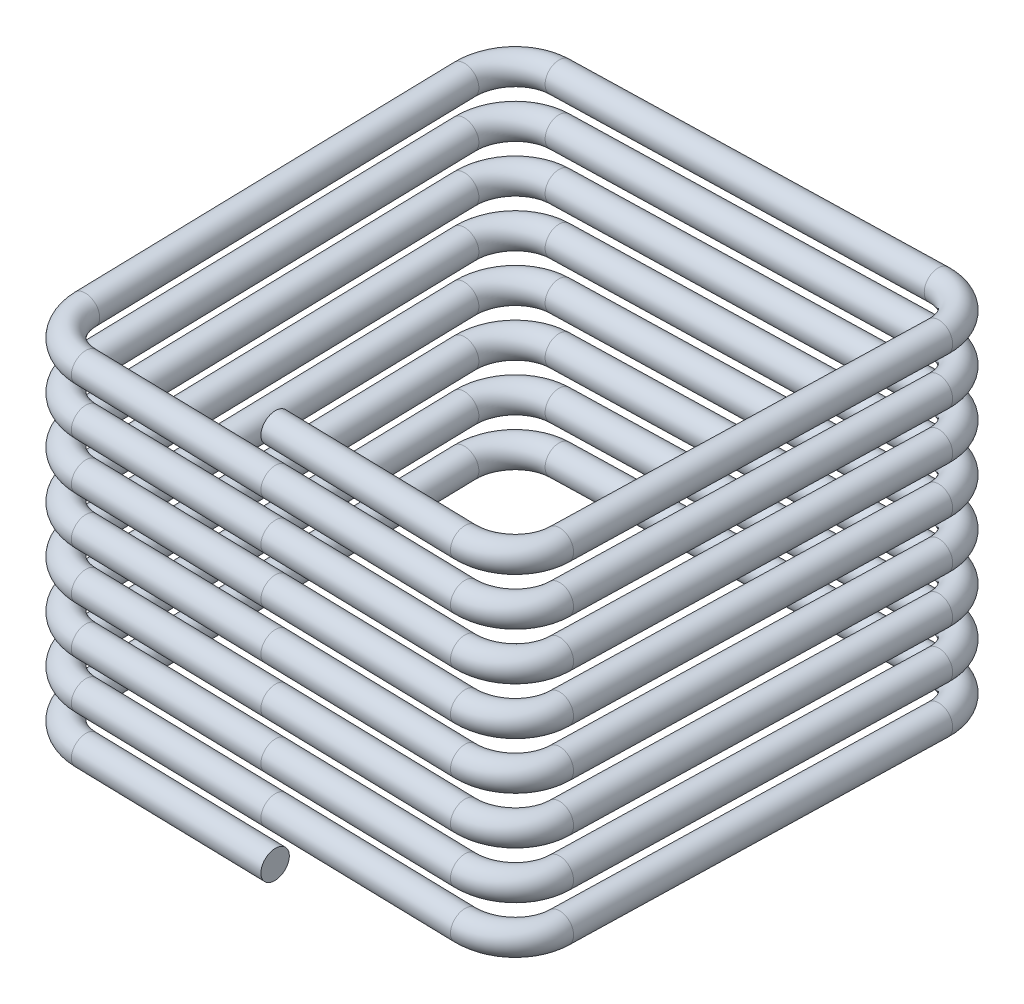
ISO-10303-21;
HEADER;
FILE_DESCRIPTION(('STEP AP214'),'2;1');
FILE_NAME('part.step','',(''),(''),'','','');
FILE_SCHEMA(('AUTOMOTIVE_DESIGN { 1 0 10303 214 1 1 1 1 }'));
ENDSEC;
DATA;
#1=APPLICATION_CONTEXT('core data for automotive mechanical design processes');
#2=APPLICATION_PROTOCOL_DEFINITION('international standard','automotive_design',2000,#1);
#3=PRODUCT_CONTEXT('',#1,'mechanical');
#4=PRODUCT('Part','Part','',(#3));
#5=PRODUCT_RELATED_PRODUCT_CATEGORY('part','',(#4));
#6=PRODUCT_DEFINITION_FORMATION('','',#4);
#7=PRODUCT_DEFINITION_CONTEXT('part definition',#1,'design');
#8=PRODUCT_DEFINITION('design','',#6,#7);
#9=PRODUCT_DEFINITION_SHAPE('','',#8);
#10=(LENGTH_UNIT() NAMED_UNIT(*) SI_UNIT(.MILLI.,.METRE.));
#11=(NAMED_UNIT(*) PLANE_ANGLE_UNIT() SI_UNIT($,.RADIAN.));
#12=(NAMED_UNIT(*) SI_UNIT($,.STERADIAN.) SOLID_ANGLE_UNIT());
#13=UNCERTAINTY_MEASURE_WITH_UNIT(LENGTH_MEASURE(1.E-05),#10,'distance_accuracy_value','');
#14=(GEOMETRIC_REPRESENTATION_CONTEXT(3) GLOBAL_UNCERTAINTY_ASSIGNED_CONTEXT((#13)) GLOBAL_UNIT_ASSIGNED_CONTEXT((#10,
#11,#12)) REPRESENTATION_CONTEXT('',''));
#15=CARTESIAN_POINT('',(0.,0.,0.));
#16=DIRECTION('',(0.,0.,1.));
#17=DIRECTION('',(1.,0.,0.));
#18=AXIS2_PLACEMENT_3D('',#15,#16,#17);
#19=CARTESIAN_POINT('',(40.0093657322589,10.2497658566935,50.0000000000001));
#20=DIRECTION('',(-0.999687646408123,0.024992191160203,0.));
#21=DIRECTION('',(-0.024992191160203,-0.999687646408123,0.));
#22=AXIS2_PLACEMENT_3D('',#19,#20,#21);
#23=CYLINDRICAL_SURFACE('',#22,3.);
#24=CARTESIAN_POINT('',(40.0093657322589,10.2497658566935,50.0000000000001));
#25=DIRECTION('',(-0.999687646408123,0.0249921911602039,0.));
#26=DIRECTION('',(-0.0244945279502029,-0.979781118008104,0.198567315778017));
#27=AXIS2_PLACEMENT_3D('',#24,#25,#26);
#28=CIRCLE('',#27,3.);
#29=CARTESIAN_POINT('',(40.0112389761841,10.3246956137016,52.9990635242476));
#30=VERTEX_POINT('',#29);
#31=EDGE_CURVE('E37',#30,#30,#28,.T.);
#32=ORIENTED_EDGE('',*,*,#31,.T.);
#33=EDGE_LOOP('',(#32));
#34=FACE_BOUND('',#33,.T.);
#35=CARTESIAN_POINT('',(-7.53487550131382E-10,11.2500000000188,50.));
#36=DIRECTION('',(-0.999687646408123,0.0249921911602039,0.));
#37=DIRECTION('',(-0.0244945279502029,-0.979781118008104,0.198567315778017));
#38=AXIS2_PLACEMENT_3D('',#35,#36,#37);
#39=CIRCLE('',#38,3.);
#40=CARTESIAN_POINT('',(-0.0734835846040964,8.31065664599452,50.595701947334));
#41=VERTEX_POINT('',#40);
#42=EDGE_CURVE('E10',#41,#41,#39,.T.);
#43=ORIENTED_EDGE('',*,*,#42,.F.);
#44=EDGE_LOOP('',(#43));
#45=FACE_BOUND('',#44,.T.);
#46=ADVANCED_FACE('F31',(#34,#45),#23,.T.);
#47=CARTESIAN_POINT('',(40.0031215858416,10.,40.0031215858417));
#48=DIRECTION('',(-0.0249843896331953,-0.999375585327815,0.0249843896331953));
#49=DIRECTION('',(0.,-0.024992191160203,-0.999687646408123));
#50=AXIS2_PLACEMENT_3D('',#47,#48,#49);
#51=TOROIDAL_SURFACE('',#50,9.99999999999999,3.);
#52=CARTESIAN_POINT('',(49.9999999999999,9.75023414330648,40.009365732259));
#53=DIRECTION('',(0.,0.0249921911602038,0.999687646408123));
#54=DIRECTION('',(0.149360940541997,-0.988473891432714,0.0247118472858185));
#55=AXIS2_PLACEMENT_3D('',#52,#53,#54);
#56=CIRCLE('',#55,3.);
#57=CARTESIAN_POINT('',(52.9990635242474,9.67530438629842,40.0112389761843));
#58=VERTEX_POINT('',#57);
#59=EDGE_CURVE('E41',#58,#58,#56,.T.);
#60=CARTESIAN_POINT('',(40.0031215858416,10.,40.0031215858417));
#61=DIRECTION('',(-0.0249843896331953,-0.999375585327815,0.0249843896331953));
#62=DIRECTION('',(0.,-0.024992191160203,-0.999687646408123));
#63=AXIS2_PLACEMENT_3D('',#60,#61,#62);
#64=CIRCLE('',#63,13.);
#65=EDGE_CURVE('',#58,#30,#64,.T.);
#66=ORIENTED_EDGE('',*,*,#59,.T.);
#67=ORIENTED_EDGE('',*,*,#31,.F.);
#68=ORIENTED_EDGE('',*,*,#65,.T.);
#69=ORIENTED_EDGE('',*,*,#65,.F.);
#70=EDGE_LOOP('',(#66,#68,#67,#69));
#71=FACE_BOUND('',#70,.T.);
#72=ADVANCED_FACE('F285',(#71),#51,.T.);
#73=CARTESIAN_POINT('',(50.0000000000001,7.74976585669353,-40.0093657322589));
#74=DIRECTION('',(0.,0.024992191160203,0.999687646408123));
#75=DIRECTION('',(0.,-0.999687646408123,0.024992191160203));
#76=AXIS2_PLACEMENT_3D('',#73,#74,#75);
#77=CYLINDRICAL_SURFACE('',#76,3.);
#78=CARTESIAN_POINT('',(50.0000000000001,7.74976585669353,-40.0093657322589));
#79=DIRECTION('',(0.,0.0249921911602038,0.999687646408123));
#80=DIRECTION('',(0.149360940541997,-0.988473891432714,0.0247118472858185));
#81=AXIS2_PLACEMENT_3D('',#78,#79,#80);
#82=CIRCLE('',#81,3.);
#83=CARTESIAN_POINT('',(52.9990635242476,7.82469561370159,-40.0112389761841));
#84=VERTEX_POINT('',#83);
#85=EDGE_CURVE('E45',#84,#84,#82,.T.);
#86=ORIENTED_EDGE('',*,*,#85,.T.);
#87=EDGE_LOOP('',(#86));
#88=FACE_BOUND('',#87,.T.);
#89=ORIENTED_EDGE('',*,*,#59,.F.);
#90=EDGE_LOOP('',(#89));
#91=FACE_BOUND('',#90,.T.);
#92=ADVANCED_FACE('F289',(#88,#91),#77,.T.);
#93=CARTESIAN_POINT('',(40.0031215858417,7.50000000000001,-40.0031215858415));
#94=DIRECTION('',(0.0249843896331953,-0.999375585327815,0.0249843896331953));
#95=DIRECTION('',(0.,-0.0249921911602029,-0.999687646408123));
#96=AXIS2_PLACEMENT_3D('',#93,#94,#95);
#97=TOROIDAL_SURFACE('',#96,10.,3.);
#98=CARTESIAN_POINT('',(40.009365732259,7.25023414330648,-49.9999999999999));
#99=DIRECTION('',(0.999687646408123,0.0249921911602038,0.));
#100=DIRECTION('',(0.0248674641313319,-0.994698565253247,-0.0997816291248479));
#101=AXIS2_PLACEMENT_3D('',#98,#99,#100);
#102=CIRCLE('',#101,3.);
#103=CARTESIAN_POINT('',(40.0112389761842,7.17530438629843,-52.9990635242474));
#104=VERTEX_POINT('',#103);
#105=EDGE_CURVE('E50',#104,#104,#102,.T.);
#106=CARTESIAN_POINT('',(40.0031215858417,7.50000000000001,-40.0031215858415));
#107=DIRECTION('',(0.0249843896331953,-0.999375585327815,0.0249843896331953));
#108=DIRECTION('',(0.,-0.0249921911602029,-0.999687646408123));
#109=AXIS2_PLACEMENT_3D('',#106,#107,#108);
#110=CIRCLE('',#109,13.);
#111=EDGE_CURVE('',#104,#84,#110,.T.);
#112=ORIENTED_EDGE('',*,*,#105,.T.);
#113=ORIENTED_EDGE('',*,*,#85,.F.);
#114=ORIENTED_EDGE('',*,*,#111,.T.);
#115=ORIENTED_EDGE('',*,*,#111,.F.);
#116=EDGE_LOOP('',(#112,#114,#113,#115));
#117=FACE_BOUND('',#116,.T.);
#118=ADVANCED_FACE('F295',(#117),#97,.T.);
#119=CARTESIAN_POINT('',(-40.009365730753,5.24976585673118,-50.0000000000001));
#120=DIRECTION('',(0.999687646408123,0.0249921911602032,0.));
#121=DIRECTION('',(-0.0249921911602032,0.999687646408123,0.));
#122=AXIS2_PLACEMENT_3D('',#119,#120,#121);
#123=CYLINDRICAL_SURFACE('',#122,3.);
#124=CARTESIAN_POINT('',(-40.009365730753,5.24976585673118,-50.0000000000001));
#125=DIRECTION('',(0.999687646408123,0.0249921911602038,0.));
#126=DIRECTION('',(0.0248674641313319,-0.994698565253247,-0.0997816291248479));
#127=AXIS2_PLACEMENT_3D('',#124,#125,#126);
#128=CIRCLE('',#127,3.);
#129=CARTESIAN_POINT('',(-40.0112389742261,5.32469559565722,-52.9990635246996));
#130=VERTEX_POINT('',#129);
#131=EDGE_CURVE('E53',#130,#130,#128,.T.);
#132=ORIENTED_EDGE('',*,*,#131,.T.);
#133=EDGE_LOOP('',(#132));
#134=FACE_BOUND('',#133,.T.);
#135=ORIENTED_EDGE('',*,*,#105,.F.);
#136=EDGE_LOOP('',(#135));
#137=FACE_BOUND('',#136,.T.);
#138=ADVANCED_FACE('F302',(#134,#137),#123,.T.);
#139=CARTESIAN_POINT('',(-40.0031215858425,5.00000006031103,-40.0031215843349));
#140=DIRECTION('',(0.0249843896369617,-0.999375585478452,-0.0249843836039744));
#141=DIRECTION('',(0.999687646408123,0.0249921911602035,0.));
#142=AXIS2_PLACEMENT_3D('',#139,#140,#141);
#143=TOROIDAL_SURFACE('',#142,10.,3.);
#144=CARTESIAN_POINT('',(-49.9999999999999,4.75023420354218,-40.0093657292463));
#145=DIRECTION('',(0.,0.0249921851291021,-0.999687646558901));
#146=DIRECTION('',(-0.0499531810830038,-0.998439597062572,-0.0249609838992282));
#147=AXIS2_PLACEMENT_3D('',#144,#145,#146);
#148=CIRCLE('',#147,3.);
#149=CARTESIAN_POINT('',(-52.9990635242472,4.67530444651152,-40.0112389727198));
#150=VERTEX_POINT('',#149);
#151=EDGE_CURVE('E56',#150,#150,#148,.T.);
#152=CARTESIAN_POINT('',(-40.0031215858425,5.00000006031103,-40.0031215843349));
#153=DIRECTION('',(0.0249843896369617,-0.999375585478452,-0.0249843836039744));
#154=DIRECTION('',(0.999687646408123,0.0249921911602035,0.));
#155=AXIS2_PLACEMENT_3D('',#152,#153,#154);
#156=CIRCLE('',#155,13.);
#157=EDGE_CURVE('',#150,#130,#156,.T.);
#158=ORIENTED_EDGE('',*,*,#151,.T.);
#159=ORIENTED_EDGE('',*,*,#131,.F.);
#160=ORIENTED_EDGE('',*,*,#157,.T.);
#161=ORIENTED_EDGE('',*,*,#157,.F.);
#162=EDGE_LOOP('',(#158,#160,#159,#161));
#163=FACE_BOUND('',#162,.T.);
#164=ADVANCED_FACE('F306',(#163),#143,.T.);
#165=CARTESIAN_POINT('',(-50.0000000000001,2.7497664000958,40.009365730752));
#166=DIRECTION('',(0.,0.0249921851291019,-0.9996876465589));
#167=DIRECTION('',(0.,0.9996876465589,0.0249921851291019));
#168=AXIS2_PLACEMENT_3D('',#165,#166,#167);
#169=CYLINDRICAL_SURFACE('',#168,3.);
#170=CARTESIAN_POINT('',(-50.0000000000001,2.7497664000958,40.009365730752));
#171=DIRECTION('',(0.,0.0249921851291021,-0.999687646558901));
#172=DIRECTION('',(-0.0499531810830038,-0.998439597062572,-0.0249609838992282));
#173=AXIS2_PLACEMENT_3D('',#170,#171,#172);
#174=CIRCLE('',#173,3.);
#175=CARTESIAN_POINT('',(-52.9990635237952,2.82469617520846,40.0112389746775));
#176=VERTEX_POINT('',#175);
#177=EDGE_CURVE('E59',#176,#176,#174,.T.);
#178=ORIENTED_EDGE('',*,*,#177,.T.);
#179=EDGE_LOOP('',(#178));
#180=FACE_BOUND('',#179,.T.);
#181=ORIENTED_EDGE('',*,*,#151,.F.);
#182=EDGE_LOOP('',(#181));
#183=FACE_BOUND('',#182,.T.);
#184=ADVANCED_FACE('F310',(#180,#183),#169,.T.);
#185=CARTESIAN_POINT('',(-40.0031215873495,2.50000048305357,40.0031215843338));
#186=DIRECTION('',(-0.0249843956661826,-0.999375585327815,-0.0249843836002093));
#187=DIRECTION('',(0.999687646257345,-0.0249921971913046,0.));
#188=AXIS2_PLACEMENT_3D('',#185,#186,#187);
#189=TOROIDAL_SURFACE('',#188,10.,3.);
#190=CARTESIAN_POINT('',(-40.0093657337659,2.25023468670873,49.9999999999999));
#191=DIRECTION('',(-0.999687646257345,0.0249921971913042,0.));
#192=DIRECTION('',(-0.0249921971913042,-0.999687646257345,0.));
#193=AXIS2_PLACEMENT_3D('',#190,#191,#192);
#194=CIRCLE('',#193,3.);
#195=CARTESIAN_POINT('',(-40.0112389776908,2.17530494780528,52.9990635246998));
#196=VERTEX_POINT('',#195);
#197=EDGE_CURVE('E62',#196,#196,#194,.T.);
#198=CARTESIAN_POINT('',(-40.0031215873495,2.50000048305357,40.0031215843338));
#199=DIRECTION('',(-0.0249843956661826,-0.999375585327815,-0.0249843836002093));
#200=DIRECTION('',(0.999687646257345,-0.0249921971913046,0.));
#201=AXIS2_PLACEMENT_3D('',#198,#199,#200);
#202=CIRCLE('',#201,13.);
#203=EDGE_CURVE('',#196,#176,#202,.T.);
#204=ORIENTED_EDGE('',*,*,#197,.T.);
#205=ORIENTED_EDGE('',*,*,#177,.F.);
#206=ORIENTED_EDGE('',*,*,#203,.T.);
#207=ORIENTED_EDGE('',*,*,#203,.F.);
#208=EDGE_LOOP('',(#204,#206,#205,#207));
#209=FACE_BOUND('',#208,.T.);
#210=ADVANCED_FACE('F314',(#209),#189,.T.);
#211=CARTESIAN_POINT('',(-40.0093657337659,2.25023468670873,49.9999999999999));
#212=DIRECTION('',(0.999687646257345,-0.0249921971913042,0.));
#213=DIRECTION('',(0.0249921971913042,0.999687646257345,0.));
#214=AXIS2_PLACEMENT_3D('',#211,#212,#213);
#215=CYLINDRICAL_SURFACE('',#214,3.);
#216=ORIENTED_EDGE('',*,*,#197,.F.);
#217=EDGE_LOOP('',(#216));
#218=FACE_BOUND('',#217,.T.);
#219=CARTESIAN_POINT('',(-7.5350576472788E-10,1.25000030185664,50.));
#220=DIRECTION('',(-0.999687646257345,0.0249921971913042,0.));
#221=DIRECTION('',(-0.0249921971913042,-0.999687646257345,0.));
#222=AXIS2_PLACEMENT_3D('',#219,#220,#221);
#223=CIRCLE('',#222,3.);
#224=CARTESIAN_POINT('',(-0.0749765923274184,-1.7490626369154,50.));
#225=VERTEX_POINT('',#224);
#226=EDGE_CURVE('E63',#225,#225,#223,.T.);
#227=ORIENTED_EDGE('',*,*,#226,.T.);
#228=EDGE_LOOP('',(#227));
#229=FACE_BOUND('',#228,.T.);
#230=ADVANCED_FACE('F318',(#218,#229),#215,.T.);
#231=CARTESIAN_POINT('',(-7.5350576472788E-10,1.25000030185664,50.));
#232=DIRECTION('',(-0.999687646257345,0.0249921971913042,0.));
#233=DIRECTION('',(-0.0249921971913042,-0.999687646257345,0.));
#234=AXIS2_PLACEMENT_3D('',#231,#232,#233);
#235=PLANE('',#234);
#236=ORIENTED_EDGE('',*,*,#226,.F.);
#237=EDGE_LOOP('',(#236));
#238=FACE_BOUND('',#237,.T.);
#239=ADVANCED_FACE('F322',(#238),#235,.F.);
#240=CARTESIAN_POINT('',(40.0093657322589,20.2497658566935,50.0000000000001));
#241=DIRECTION('',(-0.999687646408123,0.024992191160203,0.));
#242=DIRECTION('',(-0.024992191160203,-0.999687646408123,0.));
#243=AXIS2_PLACEMENT_3D('',#240,#241,#242);
#244=CYLINDRICAL_SURFACE('',#243,3.);
#245=CARTESIAN_POINT('',(40.0093657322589,20.2497658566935,50.0000000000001));
#246=DIRECTION('',(-0.999687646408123,0.0249921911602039,0.));
#247=DIRECTION('',(-0.0244945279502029,-0.979781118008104,0.198567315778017));
#248=AXIS2_PLACEMENT_3D('',#245,#246,#247);
#249=CIRCLE('',#248,3.);
#250=CARTESIAN_POINT('',(40.011238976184,20.3246956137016,52.9990635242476));
#251=VERTEX_POINT('',#250);
#252=EDGE_CURVE('E71',#251,#251,#249,.T.);
#253=ORIENTED_EDGE('',*,*,#252,.T.);
#254=EDGE_LOOP('',(#253));
#255=FACE_BOUND('',#254,.T.);
#256=CARTESIAN_POINT('',(-7.53522244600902E-10,21.2500000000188,50.));
#257=DIRECTION('',(-0.999687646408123,0.0249921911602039,0.));
#258=DIRECTION('',(-0.0244945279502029,-0.979781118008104,0.198567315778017));
#259=AXIS2_PLACEMENT_3D('',#256,#257,#258);
#260=CIRCLE('',#259,3.);
#261=CARTESIAN_POINT('',(-0.0734835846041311,18.3106566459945,50.595701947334));
#262=VERTEX_POINT('',#261);
#263=EDGE_CURVE('E66',#262,#262,#260,.T.);
#264=ORIENTED_EDGE('',*,*,#263,.F.);
#265=EDGE_LOOP('',(#264));
#266=FACE_BOUND('',#265,.T.);
#267=ADVANCED_FACE('F326',(#255,#266),#244,.T.);
#268=CARTESIAN_POINT('',(40.0031215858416,20.,40.0031215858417));
#269=DIRECTION('',(-0.0249843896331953,-0.999375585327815,0.0249843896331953));
#270=DIRECTION('',(0.,-0.024992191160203,-0.999687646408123));
#271=AXIS2_PLACEMENT_3D('',#268,#269,#270);
#272=TOROIDAL_SURFACE('',#271,9.99999999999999,3.);
#273=CARTESIAN_POINT('',(49.9999999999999,19.7502341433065,40.0093657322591));
#274=DIRECTION('',(0.,0.0249921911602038,0.999687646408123));
#275=DIRECTION('',(0.149360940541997,-0.988473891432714,0.0247118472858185));
#276=AXIS2_PLACEMENT_3D('',#273,#274,#275);
#277=CIRCLE('',#276,3.);
#278=CARTESIAN_POINT('',(52.9990635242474,19.6753043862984,40.0112389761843));
#279=VERTEX_POINT('',#278);
#280=EDGE_CURVE('E74',#279,#279,#277,.T.);
#281=CARTESIAN_POINT('',(40.0031215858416,20.,40.0031215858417));
#282=DIRECTION('',(-0.0249843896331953,-0.999375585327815,0.0249843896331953));
#283=DIRECTION('',(0.,-0.024992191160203,-0.999687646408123));
#284=AXIS2_PLACEMENT_3D('',#281,#282,#283);
#285=CIRCLE('',#284,13.);
#286=EDGE_CURVE('',#279,#251,#285,.T.);
#287=ORIENTED_EDGE('',*,*,#280,.T.);
#288=ORIENTED_EDGE('',*,*,#252,.F.);
#289=ORIENTED_EDGE('',*,*,#286,.T.);
#290=ORIENTED_EDGE('',*,*,#286,.F.);
#291=EDGE_LOOP('',(#287,#289,#288,#290));
#292=FACE_BOUND('',#291,.T.);
#293=ADVANCED_FACE('F330',(#292),#272,.T.);
#294=CARTESIAN_POINT('',(50.0000000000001,17.7497658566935,-40.0093657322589));
#295=DIRECTION('',(0.,0.024992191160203,0.999687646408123));
#296=DIRECTION('',(0.,-0.999687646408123,0.024992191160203));
#297=AXIS2_PLACEMENT_3D('',#294,#295,#296);
#298=CYLINDRICAL_SURFACE('',#297,3.);
#299=CARTESIAN_POINT('',(50.0000000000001,17.7497658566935,-40.0093657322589));
#300=DIRECTION('',(0.,0.0249921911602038,0.999687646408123));
#301=DIRECTION('',(0.149360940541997,-0.988473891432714,0.0247118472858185));
#302=AXIS2_PLACEMENT_3D('',#299,#300,#301);
#303=CIRCLE('',#302,3.);
#304=CARTESIAN_POINT('',(52.9990635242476,17.8246956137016,-40.011238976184));
#305=VERTEX_POINT('',#304);
#306=EDGE_CURVE('E77',#305,#305,#303,.T.);
#307=ORIENTED_EDGE('',*,*,#306,.T.);
#308=EDGE_LOOP('',(#307));
#309=FACE_BOUND('',#308,.T.);
#310=ORIENTED_EDGE('',*,*,#280,.F.);
#311=EDGE_LOOP('',(#310));
#312=FACE_BOUND('',#311,.T.);
#313=ADVANCED_FACE('F334',(#309,#312),#298,.T.);
#314=CARTESIAN_POINT('',(40.0031215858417,17.5,-40.0031215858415));
#315=DIRECTION('',(0.0249843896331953,-0.999375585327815,0.0249843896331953));
#316=DIRECTION('',(0.,-0.0249921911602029,-0.999687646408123));
#317=AXIS2_PLACEMENT_3D('',#314,#315,#316);
#318=TOROIDAL_SURFACE('',#317,10.,3.);
#319=CARTESIAN_POINT('',(40.009365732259,17.2502341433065,-49.9999999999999));
#320=DIRECTION('',(0.999687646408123,0.0249921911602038,0.));
#321=DIRECTION('',(0.0248674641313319,-0.994698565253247,-0.0997816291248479));
#322=AXIS2_PLACEMENT_3D('',#319,#320,#321);
#323=CIRCLE('',#322,3.);
#324=CARTESIAN_POINT('',(40.0112389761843,17.1753043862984,-52.9990635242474));
#325=VERTEX_POINT('',#324);
#326=EDGE_CURVE('E80',#325,#325,#323,.T.);
#327=CARTESIAN_POINT('',(40.0031215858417,17.5,-40.0031215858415));
#328=DIRECTION('',(0.0249843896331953,-0.999375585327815,0.0249843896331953));
#329=DIRECTION('',(0.,-0.0249921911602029,-0.999687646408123));
#330=AXIS2_PLACEMENT_3D('',#327,#328,#329);
#331=CIRCLE('',#330,13.);
#332=EDGE_CURVE('',#325,#305,#331,.T.);
#333=ORIENTED_EDGE('',*,*,#326,.T.);
#334=ORIENTED_EDGE('',*,*,#306,.F.);
#335=ORIENTED_EDGE('',*,*,#332,.T.);
#336=ORIENTED_EDGE('',*,*,#332,.F.);
#337=EDGE_LOOP('',(#333,#335,#334,#336));
#338=FACE_BOUND('',#337,.T.);
#339=ADVANCED_FACE('F338',(#338),#318,.T.);
#340=CARTESIAN_POINT('',(-40.009365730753,15.2497658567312,-50.0000000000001));
#341=DIRECTION('',(0.999687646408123,0.0249921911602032,0.));
#342=DIRECTION('',(-0.0249921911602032,0.999687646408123,0.));
#343=AXIS2_PLACEMENT_3D('',#340,#341,#342);
#344=CYLINDRICAL_SURFACE('',#343,3.);
#345=CARTESIAN_POINT('',(-40.009365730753,15.2497658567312,-50.0000000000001));
#346=DIRECTION('',(0.999687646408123,0.0249921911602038,0.));
#347=DIRECTION('',(0.0248674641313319,-0.994698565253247,-0.0997816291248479));
#348=AXIS2_PLACEMENT_3D('',#345,#346,#347);
#349=CIRCLE('',#348,3.);
#350=CARTESIAN_POINT('',(-40.0112389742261,15.3246955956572,-52.9990635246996));
#351=VERTEX_POINT('',#350);
#352=EDGE_CURVE('E83',#351,#351,#349,.T.);
#353=ORIENTED_EDGE('',*,*,#352,.T.);
#354=EDGE_LOOP('',(#353));
#355=FACE_BOUND('',#354,.T.);
#356=ORIENTED_EDGE('',*,*,#326,.F.);
#357=EDGE_LOOP('',(#356));
#358=FACE_BOUND('',#357,.T.);
#359=ADVANCED_FACE('F342',(#355,#358),#344,.T.);
#360=CARTESIAN_POINT('',(-40.0031215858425,15.000000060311,-40.0031215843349));
#361=DIRECTION('',(0.0249843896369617,-0.999375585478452,-0.0249843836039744));
#362=DIRECTION('',(0.999687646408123,0.0249921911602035,0.));
#363=AXIS2_PLACEMENT_3D('',#360,#361,#362);
#364=TOROIDAL_SURFACE('',#363,10.,3.);
#365=CARTESIAN_POINT('',(-49.9999999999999,14.7502342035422,-40.0093657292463));
#366=DIRECTION('',(0.,0.0249921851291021,-0.999687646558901));
#367=DIRECTION('',(-0.0499531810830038,-0.998439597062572,-0.0249609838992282));
#368=AXIS2_PLACEMENT_3D('',#365,#366,#367);
#369=CIRCLE('',#368,3.);
#370=CARTESIAN_POINT('',(-52.9990635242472,14.6753044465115,-40.0112389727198));
#371=VERTEX_POINT('',#370);
#372=EDGE_CURVE('E86',#371,#371,#369,.T.);
#373=CARTESIAN_POINT('',(-40.0031215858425,15.000000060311,-40.0031215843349));
#374=DIRECTION('',(0.0249843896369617,-0.999375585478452,-0.0249843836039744));
#375=DIRECTION('',(0.999687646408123,0.0249921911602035,0.));
#376=AXIS2_PLACEMENT_3D('',#373,#374,#375);
#377=CIRCLE('',#376,13.);
#378=EDGE_CURVE('',#371,#351,#377,.T.);
#379=ORIENTED_EDGE('',*,*,#372,.T.);
#380=ORIENTED_EDGE('',*,*,#352,.F.);
#381=ORIENTED_EDGE('',*,*,#378,.T.);
#382=ORIENTED_EDGE('',*,*,#378,.F.);
#383=EDGE_LOOP('',(#379,#381,#380,#382));
#384=FACE_BOUND('',#383,.T.);
#385=ADVANCED_FACE('F346',(#384),#364,.T.);
#386=CARTESIAN_POINT('',(-50.0000000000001,12.7497664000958,40.009365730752));
#387=DIRECTION('',(0.,0.0249921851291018,-0.9996876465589));
#388=DIRECTION('',(0.,0.9996876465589,0.0249921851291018));
#389=AXIS2_PLACEMENT_3D('',#386,#387,#388);
#390=CYLINDRICAL_SURFACE('',#389,3.);
#391=CARTESIAN_POINT('',(-50.0000000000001,12.7497664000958,40.009365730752));
#392=DIRECTION('',(0.,0.0249921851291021,-0.999687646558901));
#393=DIRECTION('',(-0.0499531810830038,-0.998439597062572,-0.0249609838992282));
#394=AXIS2_PLACEMENT_3D('',#391,#392,#393);
#395=CIRCLE('',#394,3.);
#396=CARTESIAN_POINT('',(-52.9990635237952,12.8246961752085,40.0112389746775));
#397=VERTEX_POINT('',#396);
#398=EDGE_CURVE('E89',#397,#397,#395,.T.);
#399=ORIENTED_EDGE('',*,*,#398,.T.);
#400=EDGE_LOOP('',(#399));
#401=FACE_BOUND('',#400,.T.);
#402=ORIENTED_EDGE('',*,*,#372,.F.);
#403=EDGE_LOOP('',(#402));
#404=FACE_BOUND('',#403,.T.);
#405=ADVANCED_FACE('F350',(#401,#404),#390,.T.);
#406=CARTESIAN_POINT('',(-40.0031215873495,12.5000004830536,40.0031215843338));
#407=DIRECTION('',(-0.0249843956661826,-0.999375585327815,-0.0249843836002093));
#408=DIRECTION('',(0.999687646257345,-0.0249921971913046,0.));
#409=AXIS2_PLACEMENT_3D('',#406,#407,#408);
#410=TOROIDAL_SURFACE('',#409,10.,3.);
#411=CARTESIAN_POINT('',(-40.0093657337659,12.2502346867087,49.9999999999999));
#412=DIRECTION('',(-0.999687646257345,0.0249921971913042,0.));
#413=DIRECTION('',(-0.0249921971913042,-0.999687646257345,0.));
#414=AXIS2_PLACEMENT_3D('',#411,#412,#413);
#415=CIRCLE('',#414,3.);
#416=CARTESIAN_POINT('',(-40.0112389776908,12.1753049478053,52.9990635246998));
#417=VERTEX_POINT('',#416);
#418=EDGE_CURVE('E92',#417,#417,#415,.T.);
#419=CARTESIAN_POINT('',(-40.0031215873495,12.5000004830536,40.0031215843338));
#420=DIRECTION('',(-0.0249843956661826,-0.999375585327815,-0.0249843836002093));
#421=DIRECTION('',(0.999687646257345,-0.0249921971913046,0.));
#422=AXIS2_PLACEMENT_3D('',#419,#420,#421);
#423=CIRCLE('',#422,13.);
#424=EDGE_CURVE('',#417,#397,#423,.T.);
#425=ORIENTED_EDGE('',*,*,#418,.T.);
#426=ORIENTED_EDGE('',*,*,#398,.F.);
#427=ORIENTED_EDGE('',*,*,#424,.T.);
#428=ORIENTED_EDGE('',*,*,#424,.F.);
#429=EDGE_LOOP('',(#425,#427,#426,#428));
#430=FACE_BOUND('',#429,.T.);
#431=ADVANCED_FACE('F354',(#430),#410,.T.);
#432=CARTESIAN_POINT('',(-40.0093657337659,12.2502346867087,49.9999999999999));
#433=DIRECTION('',(0.999687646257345,-0.0249921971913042,0.));
#434=DIRECTION('',(0.0249921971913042,0.999687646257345,0.));
#435=AXIS2_PLACEMENT_3D('',#432,#433,#434);
#436=CYLINDRICAL_SURFACE('',#435,3.);
#437=ORIENTED_EDGE('',*,*,#418,.F.);
#438=EDGE_LOOP('',(#437));
#439=FACE_BOUND('',#438,.T.);
#440=ORIENTED_EDGE('',*,*,#42,.T.);
#441=EDGE_LOOP('',(#440));
#442=FACE_BOUND('',#441,.T.);
#443=ADVANCED_FACE('F358',(#439,#442),#436,.T.);
#444=CARTESIAN_POINT('',(40.0093657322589,30.2497658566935,50.0000000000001));
#445=DIRECTION('',(-0.999687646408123,0.024992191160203,0.));
#446=DIRECTION('',(-0.024992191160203,-0.999687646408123,0.));
#447=AXIS2_PLACEMENT_3D('',#444,#445,#446);
#448=CYLINDRICAL_SURFACE('',#447,3.);
#449=CARTESIAN_POINT('',(40.0093657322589,30.2497658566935,50.0000000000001));
#450=DIRECTION('',(-0.999687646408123,0.0249921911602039,0.));
#451=DIRECTION('',(-0.0244945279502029,-0.979781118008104,0.198567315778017));
#452=AXIS2_PLACEMENT_3D('',#449,#450,#451);
#453=CIRCLE('',#452,3.);
#454=CARTESIAN_POINT('',(40.0112389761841,30.3246956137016,52.9990635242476));
#455=VERTEX_POINT('',#454);
#456=EDGE_CURVE('E98',#455,#455,#453,.T.);
#457=ORIENTED_EDGE('',*,*,#456,.T.);
#458=EDGE_LOOP('',(#457));
#459=FACE_BOUND('',#458,.T.);
#460=CARTESIAN_POINT('',(-7.53487550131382E-10,31.2500000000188,50.));
#461=DIRECTION('',(-0.999687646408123,0.0249921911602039,0.));
#462=DIRECTION('',(-0.0244945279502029,-0.979781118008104,0.198567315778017));
#463=AXIS2_PLACEMENT_3D('',#460,#461,#462);
#464=CIRCLE('',#463,3.);
#465=CARTESIAN_POINT('',(-0.0734835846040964,28.3106566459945,50.595701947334));
#466=VERTEX_POINT('',#465);
#467=EDGE_CURVE('E95',#466,#466,#464,.T.);
#468=ORIENTED_EDGE('',*,*,#467,.F.);
#469=EDGE_LOOP('',(#468));
#470=FACE_BOUND('',#469,.T.);
#471=ADVANCED_FACE('F362',(#459,#470),#448,.T.);
#472=CARTESIAN_POINT('',(40.0031215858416,30.,40.0031215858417));
#473=DIRECTION('',(-0.0249843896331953,-0.999375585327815,0.0249843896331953));
#474=DIRECTION('',(0.,-0.024992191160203,-0.999687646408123));
#475=AXIS2_PLACEMENT_3D('',#472,#473,#474);
#476=TOROIDAL_SURFACE('',#475,9.99999999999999,3.);
#477=CARTESIAN_POINT('',(49.9999999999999,29.7502341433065,40.009365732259));
#478=DIRECTION('',(0.,0.0249921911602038,0.999687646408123));
#479=DIRECTION('',(0.149360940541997,-0.988473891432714,0.0247118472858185));
#480=AXIS2_PLACEMENT_3D('',#477,#478,#479);
#481=CIRCLE('',#480,3.);
#482=CARTESIAN_POINT('',(52.9990635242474,29.6753043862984,40.0112389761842));
#483=VERTEX_POINT('',#482);
#484=EDGE_CURVE('E101',#483,#483,#481,.T.);
#485=CARTESIAN_POINT('',(40.0031215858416,30.,40.0031215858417));
#486=DIRECTION('',(-0.0249843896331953,-0.999375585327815,0.0249843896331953));
#487=DIRECTION('',(0.,-0.024992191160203,-0.999687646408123));
#488=AXIS2_PLACEMENT_3D('',#485,#486,#487);
#489=CIRCLE('',#488,13.);
#490=EDGE_CURVE('',#483,#455,#489,.T.);
#491=ORIENTED_EDGE('',*,*,#484,.T.);
#492=ORIENTED_EDGE('',*,*,#456,.F.);
#493=ORIENTED_EDGE('',*,*,#490,.T.);
#494=ORIENTED_EDGE('',*,*,#490,.F.);
#495=EDGE_LOOP('',(#491,#493,#492,#494));
#496=FACE_BOUND('',#495,.T.);
#497=ADVANCED_FACE('F366',(#496),#476,.T.);
#498=CARTESIAN_POINT('',(50.0000000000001,27.7497658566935,-40.0093657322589));
#499=DIRECTION('',(0.,0.024992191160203,0.999687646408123));
#500=DIRECTION('',(0.,-0.999687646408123,0.024992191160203));
#501=AXIS2_PLACEMENT_3D('',#498,#499,#500);
#502=CYLINDRICAL_SURFACE('',#501,3.);
#503=CARTESIAN_POINT('',(50.0000000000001,27.7497658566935,-40.0093657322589));
#504=DIRECTION('',(0.,0.0249921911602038,0.999687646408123));
#505=DIRECTION('',(0.149360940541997,-0.988473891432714,0.0247118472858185));
#506=AXIS2_PLACEMENT_3D('',#503,#504,#505);
#507=CIRCLE('',#506,3.);
#508=CARTESIAN_POINT('',(52.9990635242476,27.8246956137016,-40.0112389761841));
#509=VERTEX_POINT('',#508);
#510=EDGE_CURVE('E104',#509,#509,#507,.T.);
#511=ORIENTED_EDGE('',*,*,#510,.T.);
#512=EDGE_LOOP('',(#511));
#513=FACE_BOUND('',#512,.T.);
#514=ORIENTED_EDGE('',*,*,#484,.F.);
#515=EDGE_LOOP('',(#514));
#516=FACE_BOUND('',#515,.T.);
#517=ADVANCED_FACE('F370',(#513,#516),#502,.T.);
#518=CARTESIAN_POINT('',(40.0031215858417,27.5,-40.0031215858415));
#519=DIRECTION('',(0.0249843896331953,-0.999375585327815,0.0249843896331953));
#520=DIRECTION('',(0.,-0.0249921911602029,-0.999687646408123));
#521=AXIS2_PLACEMENT_3D('',#518,#519,#520);
#522=TOROIDAL_SURFACE('',#521,10.,3.);
#523=CARTESIAN_POINT('',(40.009365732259,27.2502341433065,-49.9999999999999));
#524=DIRECTION('',(0.999687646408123,0.0249921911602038,0.));
#525=DIRECTION('',(0.0248674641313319,-0.994698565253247,-0.0997816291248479));
#526=AXIS2_PLACEMENT_3D('',#523,#524,#525);
#527=CIRCLE('',#526,3.);
#528=CARTESIAN_POINT('',(40.0112389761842,27.1753043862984,-52.9990635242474));
#529=VERTEX_POINT('',#528);
#530=EDGE_CURVE('E107',#529,#529,#527,.T.);
#531=CARTESIAN_POINT('',(40.0031215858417,27.5,-40.0031215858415));
#532=DIRECTION('',(0.0249843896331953,-0.999375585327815,0.0249843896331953));
#533=DIRECTION('',(0.,-0.0249921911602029,-0.999687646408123));
#534=AXIS2_PLACEMENT_3D('',#531,#532,#533);
#535=CIRCLE('',#534,13.);
#536=EDGE_CURVE('',#529,#509,#535,.T.);
#537=ORIENTED_EDGE('',*,*,#530,.T.);
#538=ORIENTED_EDGE('',*,*,#510,.F.);
#539=ORIENTED_EDGE('',*,*,#536,.T.);
#540=ORIENTED_EDGE('',*,*,#536,.F.);
#541=EDGE_LOOP('',(#537,#539,#538,#540));
#542=FACE_BOUND('',#541,.T.);
#543=ADVANCED_FACE('F374',(#542),#522,.T.);
#544=CARTESIAN_POINT('',(-40.009365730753,25.2497658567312,-50.0000000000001));
#545=DIRECTION('',(0.999687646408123,0.0249921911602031,0.));
#546=DIRECTION('',(-0.0249921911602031,0.999687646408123,0.));
#547=AXIS2_PLACEMENT_3D('',#544,#545,#546);
#548=CYLINDRICAL_SURFACE('',#547,3.);
#549=CARTESIAN_POINT('',(-40.009365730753,25.2497658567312,-50.0000000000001));
#550=DIRECTION('',(0.999687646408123,0.0249921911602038,0.));
#551=DIRECTION('',(0.0248674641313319,-0.994698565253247,-0.0997816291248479));
#552=AXIS2_PLACEMENT_3D('',#549,#550,#551);
#553=CIRCLE('',#552,3.);
#554=CARTESIAN_POINT('',(-40.0112389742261,25.3246955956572,-52.9990635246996));
#555=VERTEX_POINT('',#554);
#556=EDGE_CURVE('E110',#555,#555,#553,.T.);
#557=ORIENTED_EDGE('',*,*,#556,.T.);
#558=EDGE_LOOP('',(#557));
#559=FACE_BOUND('',#558,.T.);
#560=ORIENTED_EDGE('',*,*,#530,.F.);
#561=EDGE_LOOP('',(#560));
#562=FACE_BOUND('',#561,.T.);
#563=ADVANCED_FACE('F378',(#559,#562),#548,.T.);
#564=CARTESIAN_POINT('',(-40.0031215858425,25.000000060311,-40.0031215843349));
#565=DIRECTION('',(0.0249843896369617,-0.999375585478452,-0.0249843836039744));
#566=DIRECTION('',(0.999687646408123,0.0249921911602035,0.));
#567=AXIS2_PLACEMENT_3D('',#564,#565,#566);
#568=TOROIDAL_SURFACE('',#567,10.,3.);
#569=CARTESIAN_POINT('',(-49.9999999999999,24.7502342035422,-40.0093657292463));
#570=DIRECTION('',(0.,0.0249921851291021,-0.999687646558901));
#571=DIRECTION('',(-0.0499531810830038,-0.998439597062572,-0.0249609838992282));
#572=AXIS2_PLACEMENT_3D('',#569,#570,#571);
#573=CIRCLE('',#572,3.);
#574=CARTESIAN_POINT('',(-52.9990635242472,24.6753044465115,-40.0112389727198));
#575=VERTEX_POINT('',#574);
#576=EDGE_CURVE('E113',#575,#575,#573,.T.);
#577=CARTESIAN_POINT('',(-40.0031215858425,25.000000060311,-40.0031215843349));
#578=DIRECTION('',(0.0249843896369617,-0.999375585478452,-0.0249843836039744));
#579=DIRECTION('',(0.999687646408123,0.0249921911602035,0.));
#580=AXIS2_PLACEMENT_3D('',#577,#578,#579);
#581=CIRCLE('',#580,13.);
#582=EDGE_CURVE('',#575,#555,#581,.T.);
#583=ORIENTED_EDGE('',*,*,#576,.T.);
#584=ORIENTED_EDGE('',*,*,#556,.F.);
#585=ORIENTED_EDGE('',*,*,#582,.T.);
#586=ORIENTED_EDGE('',*,*,#582,.F.);
#587=EDGE_LOOP('',(#583,#585,#584,#586));
#588=FACE_BOUND('',#587,.T.);
#589=ADVANCED_FACE('F382',(#588),#568,.T.);
#590=CARTESIAN_POINT('',(-50.0000000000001,22.7497664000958,40.009365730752));
#591=DIRECTION('',(0.,0.0249921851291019,-0.9996876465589));
#592=DIRECTION('',(0.,0.9996876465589,0.0249921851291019));
#593=AXIS2_PLACEMENT_3D('',#590,#591,#592);
#594=CYLINDRICAL_SURFACE('',#593,3.);
#595=CARTESIAN_POINT('',(-50.0000000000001,22.7497664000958,40.009365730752));
#596=DIRECTION('',(0.,0.0249921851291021,-0.999687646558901));
#597=DIRECTION('',(-0.0499531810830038,-0.998439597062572,-0.0249609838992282));
#598=AXIS2_PLACEMENT_3D('',#595,#596,#597);
#599=CIRCLE('',#598,3.);
#600=CARTESIAN_POINT('',(-52.9990635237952,22.8246961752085,40.0112389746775));
#601=VERTEX_POINT('',#600);
#602=EDGE_CURVE('E116',#601,#601,#599,.T.);
#603=ORIENTED_EDGE('',*,*,#602,.T.);
#604=EDGE_LOOP('',(#603));
#605=FACE_BOUND('',#604,.T.);
#606=ORIENTED_EDGE('',*,*,#576,.F.);
#607=EDGE_LOOP('',(#606));
#608=FACE_BOUND('',#607,.T.);
#609=ADVANCED_FACE('F386',(#605,#608),#594,.T.);
#610=CARTESIAN_POINT('',(-40.0031215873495,22.5000004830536,40.0031215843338));
#611=DIRECTION('',(-0.0249843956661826,-0.999375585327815,-0.0249843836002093));
#612=DIRECTION('',(0.999687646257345,-0.0249921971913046,0.));
#613=AXIS2_PLACEMENT_3D('',#610,#611,#612);
#614=TOROIDAL_SURFACE('',#613,10.,3.);
#615=CARTESIAN_POINT('',(-40.0093657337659,22.2502346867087,49.9999999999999));
#616=DIRECTION('',(-0.999687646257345,0.0249921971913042,0.));
#617=DIRECTION('',(-0.0249921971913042,-0.999687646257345,0.));
#618=AXIS2_PLACEMENT_3D('',#615,#616,#617);
#619=CIRCLE('',#618,3.);
#620=CARTESIAN_POINT('',(-40.0112389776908,22.1753049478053,52.9990635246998));
#621=VERTEX_POINT('',#620);
#622=EDGE_CURVE('E119',#621,#621,#619,.T.);
#623=CARTESIAN_POINT('',(-40.0031215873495,22.5000004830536,40.0031215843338));
#624=DIRECTION('',(-0.0249843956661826,-0.999375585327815,-0.0249843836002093));
#625=DIRECTION('',(0.999687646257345,-0.0249921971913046,0.));
#626=AXIS2_PLACEMENT_3D('',#623,#624,#625);
#627=CIRCLE('',#626,13.);
#628=EDGE_CURVE('',#621,#601,#627,.T.);
#629=ORIENTED_EDGE('',*,*,#622,.T.);
#630=ORIENTED_EDGE('',*,*,#602,.F.);
#631=ORIENTED_EDGE('',*,*,#628,.T.);
#632=ORIENTED_EDGE('',*,*,#628,.F.);
#633=EDGE_LOOP('',(#629,#631,#630,#632));
#634=FACE_BOUND('',#633,.T.);
#635=ADVANCED_FACE('F390',(#634),#614,.T.);
#636=CARTESIAN_POINT('',(-40.0093657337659,22.2502346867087,49.9999999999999));
#637=DIRECTION('',(0.999687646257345,-0.0249921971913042,0.));
#638=DIRECTION('',(0.0249921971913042,0.999687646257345,0.));
#639=AXIS2_PLACEMENT_3D('',#636,#637,#638);
#640=CYLINDRICAL_SURFACE('',#639,3.);
#641=ORIENTED_EDGE('',*,*,#622,.F.);
#642=EDGE_LOOP('',(#641));
#643=FACE_BOUND('',#642,.T.);
#644=ORIENTED_EDGE('',*,*,#263,.T.);
#645=EDGE_LOOP('',(#644));
#646=FACE_BOUND('',#645,.T.);
#647=ADVANCED_FACE('F394',(#643,#646),#640,.T.);
#648=CARTESIAN_POINT('',(40.0093657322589,40.2497658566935,50.));
#649=DIRECTION('',(-0.999687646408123,0.0249921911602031,0.));
#650=DIRECTION('',(-0.0249921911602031,-0.999687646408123,0.));
#651=AXIS2_PLACEMENT_3D('',#648,#649,#650);
#652=CYLINDRICAL_SURFACE('',#651,3.);
#653=CARTESIAN_POINT('',(40.0093657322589,40.2497658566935,50.));
#654=DIRECTION('',(-0.999687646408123,0.0249921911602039,0.));
#655=DIRECTION('',(-0.0244945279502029,-0.979781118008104,0.198567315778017));
#656=AXIS2_PLACEMENT_3D('',#653,#654,#655);
#657=CIRCLE('',#656,3.);
#658=CARTESIAN_POINT('',(40.0112389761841,40.3246956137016,52.9990635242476));
#659=VERTEX_POINT('',#658);
#660=EDGE_CURVE('E125',#659,#659,#657,.T.);
#661=ORIENTED_EDGE('',*,*,#660,.T.);
#662=EDGE_LOOP('',(#661));
#663=FACE_BOUND('',#662,.T.);
#664=CARTESIAN_POINT('',(-7.5350142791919E-10,41.2500000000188,50.));
#665=DIRECTION('',(-0.999687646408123,0.0249921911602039,0.));
#666=DIRECTION('',(-0.0244945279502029,-0.979781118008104,0.198567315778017));
#667=AXIS2_PLACEMENT_3D('',#664,#665,#666);
#668=CIRCLE('',#667,3.);
#669=CARTESIAN_POINT('',(-0.0734835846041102,38.3106566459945,50.595701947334));
#670=VERTEX_POINT('',#669);
#671=EDGE_CURVE('E122',#670,#670,#668,.T.);
#672=ORIENTED_EDGE('',*,*,#671,.F.);
#673=EDGE_LOOP('',(#672));
#674=FACE_BOUND('',#673,.T.);
#675=ADVANCED_FACE('F398',(#663,#674),#652,.T.);
#676=CARTESIAN_POINT('',(40.0031215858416,40.,40.0031215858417));
#677=DIRECTION('',(-0.0249843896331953,-0.999375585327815,0.0249843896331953));
#678=DIRECTION('',(0.,-0.024992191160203,-0.999687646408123));
#679=AXIS2_PLACEMENT_3D('',#676,#677,#678);
#680=TOROIDAL_SURFACE('',#679,9.99999999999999,3.);
#681=CARTESIAN_POINT('',(49.9999999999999,39.7502341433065,40.0093657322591));
#682=DIRECTION('',(0.,0.0249921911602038,0.999687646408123));
#683=DIRECTION('',(0.149360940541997,-0.988473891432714,0.0247118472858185));
#684=AXIS2_PLACEMENT_3D('',#681,#682,#683);
#685=CIRCLE('',#684,3.);
#686=CARTESIAN_POINT('',(52.9990635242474,39.6753043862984,40.0112389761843));
#687=VERTEX_POINT('',#686);
#688=EDGE_CURVE('E128',#687,#687,#685,.T.);
#689=CARTESIAN_POINT('',(40.0031215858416,40.,40.0031215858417));
#690=DIRECTION('',(-0.0249843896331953,-0.999375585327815,0.0249843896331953));
#691=DIRECTION('',(0.,-0.024992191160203,-0.999687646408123));
#692=AXIS2_PLACEMENT_3D('',#689,#690,#691);
#693=CIRCLE('',#692,13.);
#694=EDGE_CURVE('',#687,#659,#693,.T.);
#695=ORIENTED_EDGE('',*,*,#688,.T.);
#696=ORIENTED_EDGE('',*,*,#660,.F.);
#697=ORIENTED_EDGE('',*,*,#694,.T.);
#698=ORIENTED_EDGE('',*,*,#694,.F.);
#699=EDGE_LOOP('',(#695,#697,#696,#698));
#700=FACE_BOUND('',#699,.T.);
#701=ADVANCED_FACE('F402',(#700),#680,.T.);
#702=CARTESIAN_POINT('',(50.0000000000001,37.7497658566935,-40.0093657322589));
#703=DIRECTION('',(0.,0.024992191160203,0.999687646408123));
#704=DIRECTION('',(0.,-0.999687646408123,0.024992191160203));
#705=AXIS2_PLACEMENT_3D('',#702,#703,#704);
#706=CYLINDRICAL_SURFACE('',#705,3.);
#707=CARTESIAN_POINT('',(50.0000000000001,37.7497658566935,-40.0093657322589));
#708=DIRECTION('',(0.,0.0249921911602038,0.999687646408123));
#709=DIRECTION('',(0.149360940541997,-0.988473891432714,0.0247118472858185));
#710=AXIS2_PLACEMENT_3D('',#707,#708,#709);
#711=CIRCLE('',#710,3.);
#712=CARTESIAN_POINT('',(52.9990635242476,37.8246956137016,-40.0112389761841));
#713=VERTEX_POINT('',#712);
#714=EDGE_CURVE('E131',#713,#713,#711,.T.);
#715=ORIENTED_EDGE('',*,*,#714,.T.);
#716=EDGE_LOOP('',(#715));
#717=FACE_BOUND('',#716,.T.);
#718=ORIENTED_EDGE('',*,*,#688,.F.);
#719=EDGE_LOOP('',(#718));
#720=FACE_BOUND('',#719,.T.);
#721=ADVANCED_FACE('F406',(#717,#720),#706,.T.);
#722=CARTESIAN_POINT('',(40.0031215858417,37.5,-40.0031215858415));
#723=DIRECTION('',(0.0249843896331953,-0.999375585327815,0.0249843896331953));
#724=DIRECTION('',(0.,-0.0249921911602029,-0.999687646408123));
#725=AXIS2_PLACEMENT_3D('',#722,#723,#724);
#726=TOROIDAL_SURFACE('',#725,10.,3.);
#727=CARTESIAN_POINT('',(40.009365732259,37.2502341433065,-49.9999999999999));
#728=DIRECTION('',(0.999687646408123,0.0249921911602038,0.));
#729=DIRECTION('',(0.0248674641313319,-0.994698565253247,-0.0997816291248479));
#730=AXIS2_PLACEMENT_3D('',#727,#728,#729);
#731=CIRCLE('',#730,3.);
#732=CARTESIAN_POINT('',(40.0112389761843,37.1753043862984,-52.9990635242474));
#733=VERTEX_POINT('',#732);
#734=EDGE_CURVE('E134',#733,#733,#731,.T.);
#735=CARTESIAN_POINT('',(40.0031215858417,37.5,-40.0031215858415));
#736=DIRECTION('',(0.0249843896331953,-0.999375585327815,0.0249843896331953));
#737=DIRECTION('',(0.,-0.0249921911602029,-0.999687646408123));
#738=AXIS2_PLACEMENT_3D('',#735,#736,#737);
#739=CIRCLE('',#738,13.);
#740=EDGE_CURVE('',#733,#713,#739,.T.);
#741=ORIENTED_EDGE('',*,*,#734,.T.);
#742=ORIENTED_EDGE('',*,*,#714,.F.);
#743=ORIENTED_EDGE('',*,*,#740,.T.);
#744=ORIENTED_EDGE('',*,*,#740,.F.);
#745=EDGE_LOOP('',(#741,#743,#742,#744));
#746=FACE_BOUND('',#745,.T.);
#747=ADVANCED_FACE('F410',(#746),#726,.T.);
#748=CARTESIAN_POINT('',(-40.009365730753,35.2497658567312,-50.0000000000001));
#749=DIRECTION('',(0.999687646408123,0.0249921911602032,0.));
#750=DIRECTION('',(-0.0249921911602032,0.999687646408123,0.));
#751=AXIS2_PLACEMENT_3D('',#748,#749,#750);
#752=CYLINDRICAL_SURFACE('',#751,3.);
#753=CARTESIAN_POINT('',(-40.009365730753,35.2497658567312,-50.0000000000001));
#754=DIRECTION('',(0.999687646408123,0.0249921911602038,0.));
#755=DIRECTION('',(0.0248674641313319,-0.994698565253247,-0.0997816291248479));
#756=AXIS2_PLACEMENT_3D('',#753,#754,#755);
#757=CIRCLE('',#756,3.);
#758=CARTESIAN_POINT('',(-40.0112389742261,35.3246955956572,-52.9990635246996));
#759=VERTEX_POINT('',#758);
#760=EDGE_CURVE('E137',#759,#759,#757,.T.);
#761=ORIENTED_EDGE('',*,*,#760,.T.);
#762=EDGE_LOOP('',(#761));
#763=FACE_BOUND('',#762,.T.);
#764=ORIENTED_EDGE('',*,*,#734,.F.);
#765=EDGE_LOOP('',(#764));
#766=FACE_BOUND('',#765,.T.);
#767=ADVANCED_FACE('F414',(#763,#766),#752,.T.);
#768=CARTESIAN_POINT('',(-40.0031215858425,35.000000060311,-40.0031215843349));
#769=DIRECTION('',(0.0249843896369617,-0.999375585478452,-0.0249843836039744));
#770=DIRECTION('',(0.999687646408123,0.0249921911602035,0.));
#771=AXIS2_PLACEMENT_3D('',#768,#769,#770);
#772=TOROIDAL_SURFACE('',#771,9.99999999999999,3.);
#773=CARTESIAN_POINT('',(-49.9999999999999,34.7502342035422,-40.0093657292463));
#774=DIRECTION('',(0.,0.0249921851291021,-0.999687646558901));
#775=DIRECTION('',(-0.0499531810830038,-0.998439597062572,-0.0249609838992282));
#776=AXIS2_PLACEMENT_3D('',#773,#774,#775);
#777=CIRCLE('',#776,3.);
#778=CARTESIAN_POINT('',(-52.9990635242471,34.6753044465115,-40.0112389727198));
#779=VERTEX_POINT('',#778);
#780=EDGE_CURVE('E140',#779,#779,#777,.T.);
#781=CARTESIAN_POINT('',(-40.0031215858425,35.000000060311,-40.0031215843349));
#782=DIRECTION('',(0.0249843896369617,-0.999375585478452,-0.0249843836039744));
#783=DIRECTION('',(0.999687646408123,0.0249921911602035,0.));
#784=AXIS2_PLACEMENT_3D('',#781,#782,#783);
#785=CIRCLE('',#784,13.);
#786=EDGE_CURVE('',#779,#759,#785,.T.);
#787=ORIENTED_EDGE('',*,*,#780,.T.);
#788=ORIENTED_EDGE('',*,*,#760,.F.);
#789=ORIENTED_EDGE('',*,*,#786,.T.);
#790=ORIENTED_EDGE('',*,*,#786,.F.);
#791=EDGE_LOOP('',(#787,#789,#788,#790));
#792=FACE_BOUND('',#791,.T.);
#793=ADVANCED_FACE('F418',(#792),#772,.T.);
#794=CARTESIAN_POINT('',(-50.0000000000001,32.7497664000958,40.009365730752));
#795=DIRECTION('',(0.,0.0249921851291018,-0.9996876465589));
#796=DIRECTION('',(0.,0.9996876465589,0.0249921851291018));
#797=AXIS2_PLACEMENT_3D('',#794,#795,#796);
#798=CYLINDRICAL_SURFACE('',#797,3.);
#799=CARTESIAN_POINT('',(-50.0000000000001,32.7497664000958,40.009365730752));
#800=DIRECTION('',(0.,0.0249921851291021,-0.999687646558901));
#801=DIRECTION('',(-0.0499531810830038,-0.998439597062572,-0.0249609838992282));
#802=AXIS2_PLACEMENT_3D('',#799,#800,#801);
#803=CIRCLE('',#802,3.);
#804=CARTESIAN_POINT('',(-52.9990635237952,32.8246961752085,40.0112389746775));
#805=VERTEX_POINT('',#804);
#806=EDGE_CURVE('E143',#805,#805,#803,.T.);
#807=ORIENTED_EDGE('',*,*,#806,.T.);
#808=EDGE_LOOP('',(#807));
#809=FACE_BOUND('',#808,.T.);
#810=ORIENTED_EDGE('',*,*,#780,.F.);
#811=EDGE_LOOP('',(#810));
#812=FACE_BOUND('',#811,.T.);
#813=ADVANCED_FACE('F422',(#809,#812),#798,.T.);
#814=CARTESIAN_POINT('',(-40.0031215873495,32.5000004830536,40.0031215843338));
#815=DIRECTION('',(-0.0249843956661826,-0.999375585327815,-0.0249843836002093));
#816=DIRECTION('',(0.999687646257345,-0.0249921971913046,0.));
#817=AXIS2_PLACEMENT_3D('',#814,#815,#816);
#818=TOROIDAL_SURFACE('',#817,10.,3.);
#819=CARTESIAN_POINT('',(-40.0093657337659,32.2502346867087,49.9999999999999));
#820=DIRECTION('',(-0.999687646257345,0.0249921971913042,0.));
#821=DIRECTION('',(-0.0249921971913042,-0.999687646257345,0.));
#822=AXIS2_PLACEMENT_3D('',#819,#820,#821);
#823=CIRCLE('',#822,3.);
#824=CARTESIAN_POINT('',(-40.0112389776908,32.1753049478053,52.9990635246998));
#825=VERTEX_POINT('',#824);
#826=EDGE_CURVE('E146',#825,#825,#823,.T.);
#827=CARTESIAN_POINT('',(-40.0031215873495,32.5000004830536,40.0031215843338));
#828=DIRECTION('',(-0.0249843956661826,-0.999375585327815,-0.0249843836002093));
#829=DIRECTION('',(0.999687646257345,-0.0249921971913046,0.));
#830=AXIS2_PLACEMENT_3D('',#827,#828,#829);
#831=CIRCLE('',#830,13.);
#832=EDGE_CURVE('',#825,#805,#831,.T.);
#833=ORIENTED_EDGE('',*,*,#826,.T.);
#834=ORIENTED_EDGE('',*,*,#806,.F.);
#835=ORIENTED_EDGE('',*,*,#832,.T.);
#836=ORIENTED_EDGE('',*,*,#832,.F.);
#837=EDGE_LOOP('',(#833,#835,#834,#836));
#838=FACE_BOUND('',#837,.T.);
#839=ADVANCED_FACE('F426',(#838),#818,.T.);
#840=CARTESIAN_POINT('',(-40.0093657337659,32.2502346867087,49.9999999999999));
#841=DIRECTION('',(0.999687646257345,-0.0249921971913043,0.));
#842=DIRECTION('',(0.0249921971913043,0.999687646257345,0.));
#843=AXIS2_PLACEMENT_3D('',#840,#841,#842);
#844=CYLINDRICAL_SURFACE('',#843,3.);
#845=ORIENTED_EDGE('',*,*,#826,.F.);
#846=EDGE_LOOP('',(#845));
#847=FACE_BOUND('',#846,.T.);
#848=ORIENTED_EDGE('',*,*,#467,.T.);
#849=EDGE_LOOP('',(#848));
#850=FACE_BOUND('',#849,.T.);
#851=ADVANCED_FACE('F430',(#847,#850),#844,.T.);
#852=CARTESIAN_POINT('',(40.0093657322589,50.2497658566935,50.));
#853=DIRECTION('',(-0.999687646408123,0.024992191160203,0.));
#854=DIRECTION('',(-0.024992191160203,-0.999687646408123,0.));
#855=AXIS2_PLACEMENT_3D('',#852,#853,#854);
#856=CYLINDRICAL_SURFACE('',#855,3.);
#857=CARTESIAN_POINT('',(40.0093657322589,50.2497658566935,50.));
#858=DIRECTION('',(-0.999687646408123,0.0249921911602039,0.));
#859=DIRECTION('',(-0.0244945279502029,-0.979781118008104,0.198567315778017));
#860=AXIS2_PLACEMENT_3D('',#857,#858,#859);
#861=CIRCLE('',#860,3.);
#862=CARTESIAN_POINT('',(40.0112389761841,50.3246956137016,52.9990635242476));
#863=VERTEX_POINT('',#862);
#864=EDGE_CURVE('E152',#863,#863,#861,.T.);
#865=ORIENTED_EDGE('',*,*,#864,.T.);
#866=EDGE_LOOP('',(#865));
#867=FACE_BOUND('',#866,.T.);
#868=CARTESIAN_POINT('',(-7.53508366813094E-10,51.2500000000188,50.));
#869=DIRECTION('',(-0.999687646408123,0.0249921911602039,0.));
#870=DIRECTION('',(-0.0244945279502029,-0.979781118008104,0.198567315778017));
#871=AXIS2_PLACEMENT_3D('',#868,#869,#870);
#872=CIRCLE('',#871,3.);
#873=CARTESIAN_POINT('',(-0.0734835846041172,48.3106566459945,50.595701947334));
#874=VERTEX_POINT('',#873);
#875=EDGE_CURVE('E149',#874,#874,#872,.T.);
#876=ORIENTED_EDGE('',*,*,#875,.F.);
#877=EDGE_LOOP('',(#876));
#878=FACE_BOUND('',#877,.T.);
#879=ADVANCED_FACE('F434',(#867,#878),#856,.T.);
#880=CARTESIAN_POINT('',(40.0031215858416,50.,40.0031215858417));
#881=DIRECTION('',(-0.0249843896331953,-0.999375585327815,0.0249843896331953));
#882=DIRECTION('',(0.,-0.024992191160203,-0.999687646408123));
#883=AXIS2_PLACEMENT_3D('',#880,#881,#882);
#884=TOROIDAL_SURFACE('',#883,9.99999999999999,3.);
#885=CARTESIAN_POINT('',(49.9999999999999,49.7502341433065,40.0093657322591));
#886=DIRECTION('',(0.,0.0249921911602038,0.999687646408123));
#887=DIRECTION('',(0.149360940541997,-0.988473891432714,0.0247118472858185));
#888=AXIS2_PLACEMENT_3D('',#885,#886,#887);
#889=CIRCLE('',#888,3.);
#890=CARTESIAN_POINT('',(52.9990635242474,49.6753043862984,40.0112389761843));
#891=VERTEX_POINT('',#890);
#892=EDGE_CURVE('E155',#891,#891,#889,.T.);
#893=CARTESIAN_POINT('',(40.0031215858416,50.,40.0031215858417));
#894=DIRECTION('',(-0.0249843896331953,-0.999375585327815,0.0249843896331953));
#895=DIRECTION('',(0.,-0.024992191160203,-0.999687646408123));
#896=AXIS2_PLACEMENT_3D('',#893,#894,#895);
#897=CIRCLE('',#896,13.);
#898=EDGE_CURVE('',#891,#863,#897,.T.);
#899=ORIENTED_EDGE('',*,*,#892,.T.);
#900=ORIENTED_EDGE('',*,*,#864,.F.);
#901=ORIENTED_EDGE('',*,*,#898,.T.);
#902=ORIENTED_EDGE('',*,*,#898,.F.);
#903=EDGE_LOOP('',(#899,#901,#900,#902));
#904=FACE_BOUND('',#903,.T.);
#905=ADVANCED_FACE('F438',(#904),#884,.T.);
#906=CARTESIAN_POINT('',(50.0000000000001,47.7497658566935,-40.0093657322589));
#907=DIRECTION('',(0.,0.0249921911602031,0.999687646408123));
#908=DIRECTION('',(0.,-0.999687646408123,0.0249921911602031));
#909=AXIS2_PLACEMENT_3D('',#906,#907,#908);
#910=CYLINDRICAL_SURFACE('',#909,3.);
#911=CARTESIAN_POINT('',(50.0000000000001,47.7497658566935,-40.0093657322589));
#912=DIRECTION('',(0.,0.0249921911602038,0.999687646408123));
#913=DIRECTION('',(0.149360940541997,-0.988473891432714,0.0247118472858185));
#914=AXIS2_PLACEMENT_3D('',#911,#912,#913);
#915=CIRCLE('',#914,3.);
#916=CARTESIAN_POINT('',(52.9990635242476,47.8246956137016,-40.0112389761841));
#917=VERTEX_POINT('',#916);
#918=EDGE_CURVE('E158',#917,#917,#915,.T.);
#919=ORIENTED_EDGE('',*,*,#918,.T.);
#920=EDGE_LOOP('',(#919));
#921=FACE_BOUND('',#920,.T.);
#922=ORIENTED_EDGE('',*,*,#892,.F.);
#923=EDGE_LOOP('',(#922));
#924=FACE_BOUND('',#923,.T.);
#925=ADVANCED_FACE('F442',(#921,#924),#910,.T.);
#926=CARTESIAN_POINT('',(40.0031215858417,47.5,-40.0031215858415));
#927=DIRECTION('',(0.0249843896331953,-0.999375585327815,0.0249843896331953));
#928=DIRECTION('',(0.,-0.0249921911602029,-0.999687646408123));
#929=AXIS2_PLACEMENT_3D('',#926,#927,#928);
#930=TOROIDAL_SURFACE('',#929,10.,3.);
#931=CARTESIAN_POINT('',(40.009365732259,47.2502341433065,-49.9999999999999));
#932=DIRECTION('',(0.999687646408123,0.0249921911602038,0.));
#933=DIRECTION('',(0.0248674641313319,-0.994698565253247,-0.0997816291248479));
#934=AXIS2_PLACEMENT_3D('',#931,#932,#933);
#935=CIRCLE('',#934,3.);
#936=CARTESIAN_POINT('',(40.0112389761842,47.1753043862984,-52.9990635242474));
#937=VERTEX_POINT('',#936);
#938=EDGE_CURVE('E161',#937,#937,#935,.T.);
#939=CARTESIAN_POINT('',(40.0031215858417,47.5,-40.0031215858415));
#940=DIRECTION('',(0.0249843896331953,-0.999375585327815,0.0249843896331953));
#941=DIRECTION('',(0.,-0.0249921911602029,-0.999687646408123));
#942=AXIS2_PLACEMENT_3D('',#939,#940,#941);
#943=CIRCLE('',#942,13.);
#944=EDGE_CURVE('',#937,#917,#943,.T.);
#945=ORIENTED_EDGE('',*,*,#938,.T.);
#946=ORIENTED_EDGE('',*,*,#918,.F.);
#947=ORIENTED_EDGE('',*,*,#944,.T.);
#948=ORIENTED_EDGE('',*,*,#944,.F.);
#949=EDGE_LOOP('',(#945,#947,#946,#948));
#950=FACE_BOUND('',#949,.T.);
#951=ADVANCED_FACE('F446',(#950),#930,.T.);
#952=CARTESIAN_POINT('',(-40.009365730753,45.2497658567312,-50.));
#953=DIRECTION('',(0.999687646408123,0.0249921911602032,0.));
#954=DIRECTION('',(-0.0249921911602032,0.999687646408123,0.));
#955=AXIS2_PLACEMENT_3D('',#952,#953,#954);
#956=CYLINDRICAL_SURFACE('',#955,3.);
#957=CARTESIAN_POINT('',(-40.009365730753,45.2497658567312,-50.));
#958=DIRECTION('',(0.999687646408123,0.0249921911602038,0.));
#959=DIRECTION('',(0.0248674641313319,-0.994698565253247,-0.0997816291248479));
#960=AXIS2_PLACEMENT_3D('',#957,#958,#959);
#961=CIRCLE('',#960,3.);
#962=CARTESIAN_POINT('',(-40.0112389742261,45.3246955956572,-52.9990635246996));
#963=VERTEX_POINT('',#962);
#964=EDGE_CURVE('E164',#963,#963,#961,.T.);
#965=ORIENTED_EDGE('',*,*,#964,.T.);
#966=EDGE_LOOP('',(#965));
#967=FACE_BOUND('',#966,.T.);
#968=ORIENTED_EDGE('',*,*,#938,.F.);
#969=EDGE_LOOP('',(#968));
#970=FACE_BOUND('',#969,.T.);
#971=ADVANCED_FACE('F450',(#967,#970),#956,.T.);
#972=CARTESIAN_POINT('',(-40.0031215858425,45.000000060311,-40.0031215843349));
#973=DIRECTION('',(0.0249843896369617,-0.999375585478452,-0.0249843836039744));
#974=DIRECTION('',(0.999687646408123,0.0249921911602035,0.));
#975=AXIS2_PLACEMENT_3D('',#972,#973,#974);
#976=TOROIDAL_SURFACE('',#975,9.99999999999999,3.);
#977=CARTESIAN_POINT('',(-49.9999999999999,44.7502342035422,-40.0093657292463));
#978=DIRECTION('',(0.,0.0249921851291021,-0.999687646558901));
#979=DIRECTION('',(-0.0499531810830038,-0.998439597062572,-0.0249609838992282));
#980=AXIS2_PLACEMENT_3D('',#977,#978,#979);
#981=CIRCLE('',#980,3.);
#982=CARTESIAN_POINT('',(-52.9990635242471,44.6753044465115,-40.0112389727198));
#983=VERTEX_POINT('',#982);
#984=EDGE_CURVE('E167',#983,#983,#981,.T.);
#985=CARTESIAN_POINT('',(-40.0031215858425,45.000000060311,-40.0031215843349));
#986=DIRECTION('',(0.0249843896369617,-0.999375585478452,-0.0249843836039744));
#987=DIRECTION('',(0.999687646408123,0.0249921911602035,0.));
#988=AXIS2_PLACEMENT_3D('',#985,#986,#987);
#989=CIRCLE('',#988,13.);
#990=EDGE_CURVE('',#983,#963,#989,.T.);
#991=ORIENTED_EDGE('',*,*,#984,.T.);
#992=ORIENTED_EDGE('',*,*,#964,.F.);
#993=ORIENTED_EDGE('',*,*,#990,.T.);
#994=ORIENTED_EDGE('',*,*,#990,.F.);
#995=EDGE_LOOP('',(#991,#993,#992,#994));
#996=FACE_BOUND('',#995,.T.);
#997=ADVANCED_FACE('F454',(#996),#976,.T.);
#998=CARTESIAN_POINT('',(-50.0000000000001,42.7497664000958,40.009365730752));
#999=DIRECTION('',(0.,0.0249921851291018,-0.9996876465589));
#1000=DIRECTION('',(0.,0.9996876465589,0.0249921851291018));
#1001=AXIS2_PLACEMENT_3D('',#998,#999,#1000);
#1002=CYLINDRICAL_SURFACE('',#1001,3.);
#1003=CARTESIAN_POINT('',(-50.0000000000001,42.7497664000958,40.009365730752));
#1004=DIRECTION('',(0.,0.0249921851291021,-0.999687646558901));
#1005=DIRECTION('',(-0.0499531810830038,-0.998439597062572,-0.0249609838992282));
#1006=AXIS2_PLACEMENT_3D('',#1003,#1004,#1005);
#1007=CIRCLE('',#1006,3.);
#1008=CARTESIAN_POINT('',(-52.9990635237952,42.8246961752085,40.0112389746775));
#1009=VERTEX_POINT('',#1008);
#1010=EDGE_CURVE('E170',#1009,#1009,#1007,.T.);
#1011=ORIENTED_EDGE('',*,*,#1010,.T.);
#1012=EDGE_LOOP('',(#1011));
#1013=FACE_BOUND('',#1012,.T.);
#1014=ORIENTED_EDGE('',*,*,#984,.F.);
#1015=EDGE_LOOP('',(#1014));
#1016=FACE_BOUND('',#1015,.T.);
#1017=ADVANCED_FACE('F458',(#1013,#1016),#1002,.T.);
#1018=CARTESIAN_POINT('',(-40.0031215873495,42.5000004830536,40.0031215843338));
#1019=DIRECTION('',(-0.0249843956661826,-0.999375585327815,-0.0249843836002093));
#1020=DIRECTION('',(0.999687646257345,-0.0249921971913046,0.));
#1021=AXIS2_PLACEMENT_3D('',#1018,#1019,#1020);
#1022=TOROIDAL_SURFACE('',#1021,10.,3.);
#1023=CARTESIAN_POINT('',(-40.0093657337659,42.2502346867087,49.9999999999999));
#1024=DIRECTION('',(-0.999687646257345,0.0249921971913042,0.));
#1025=DIRECTION('',(-0.0249921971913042,-0.999687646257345,0.));
#1026=AXIS2_PLACEMENT_3D('',#1023,#1024,#1025);
#1027=CIRCLE('',#1026,3.);
#1028=CARTESIAN_POINT('',(-40.0112389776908,42.1753049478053,52.9990635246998));
#1029=VERTEX_POINT('',#1028);
#1030=EDGE_CURVE('E173',#1029,#1029,#1027,.T.);
#1031=CARTESIAN_POINT('',(-40.0031215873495,42.5000004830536,40.0031215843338));
#1032=DIRECTION('',(-0.0249843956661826,-0.999375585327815,-0.0249843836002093));
#1033=DIRECTION('',(0.999687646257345,-0.0249921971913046,0.));
#1034=AXIS2_PLACEMENT_3D('',#1031,#1032,#1033);
#1035=CIRCLE('',#1034,13.);
#1036=EDGE_CURVE('',#1029,#1009,#1035,.T.);
#1037=ORIENTED_EDGE('',*,*,#1030,.T.);
#1038=ORIENTED_EDGE('',*,*,#1010,.F.);
#1039=ORIENTED_EDGE('',*,*,#1036,.T.);
#1040=ORIENTED_EDGE('',*,*,#1036,.F.);
#1041=EDGE_LOOP('',(#1037,#1039,#1038,#1040));
#1042=FACE_BOUND('',#1041,.T.);
#1043=ADVANCED_FACE('F462',(#1042),#1022,.T.);
#1044=CARTESIAN_POINT('',(-40.0093657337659,42.2502346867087,49.9999999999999));
#1045=DIRECTION('',(0.999687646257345,-0.0249921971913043,0.));
#1046=DIRECTION('',(0.0249921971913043,0.999687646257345,0.));
#1047=AXIS2_PLACEMENT_3D('',#1044,#1045,#1046);
#1048=CYLINDRICAL_SURFACE('',#1047,3.);
#1049=ORIENTED_EDGE('',*,*,#1030,.F.);
#1050=EDGE_LOOP('',(#1049));
#1051=FACE_BOUND('',#1050,.T.);
#1052=ORIENTED_EDGE('',*,*,#671,.T.);
#1053=EDGE_LOOP('',(#1052));
#1054=FACE_BOUND('',#1053,.T.);
#1055=ADVANCED_FACE('F466',(#1051,#1054),#1048,.T.);
#1056=CARTESIAN_POINT('',(40.0093657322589,60.2497658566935,50.));
#1057=DIRECTION('',(-0.999687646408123,0.0249921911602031,0.));
#1058=DIRECTION('',(-0.0249921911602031,-0.999687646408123,0.));
#1059=AXIS2_PLACEMENT_3D('',#1056,#1057,#1058);
#1060=CYLINDRICAL_SURFACE('',#1059,3.);
#1061=CARTESIAN_POINT('',(40.0093657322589,60.2497658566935,50.));
#1062=DIRECTION('',(-0.999687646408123,0.0249921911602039,0.));
#1063=DIRECTION('',(-0.0244945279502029,-0.979781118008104,0.198567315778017));
#1064=AXIS2_PLACEMENT_3D('',#1061,#1062,#1063);
#1065=CIRCLE('',#1064,3.);
#1066=CARTESIAN_POINT('',(40.0112389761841,60.3246956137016,52.9990635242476));
#1067=VERTEX_POINT('',#1066);
#1068=EDGE_CURVE('E179',#1067,#1067,#1065,.T.);
#1069=ORIENTED_EDGE('',*,*,#1068,.T.);
#1070=EDGE_LOOP('',(#1069));
#1071=FACE_BOUND('',#1070,.T.);
#1072=CARTESIAN_POINT('',(-7.5350142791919E-10,61.2500000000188,50.));
#1073=DIRECTION('',(-0.999687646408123,0.0249921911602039,0.));
#1074=DIRECTION('',(-0.0244945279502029,-0.979781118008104,0.198567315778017));
#1075=AXIS2_PLACEMENT_3D('',#1072,#1073,#1074);
#1076=CIRCLE('',#1075,3.);
#1077=CARTESIAN_POINT('',(-0.0734835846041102,58.3106566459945,50.595701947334));
#1078=VERTEX_POINT('',#1077);
#1079=EDGE_CURVE('E176',#1078,#1078,#1076,.T.);
#1080=ORIENTED_EDGE('',*,*,#1079,.F.);
#1081=EDGE_LOOP('',(#1080));
#1082=FACE_BOUND('',#1081,.T.);
#1083=ADVANCED_FACE('F470',(#1071,#1082),#1060,.T.);
#1084=CARTESIAN_POINT('',(40.0031215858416,60.,40.0031215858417));
#1085=DIRECTION('',(-0.0249843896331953,-0.999375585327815,0.0249843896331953));
#1086=DIRECTION('',(0.,-0.024992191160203,-0.999687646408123));
#1087=AXIS2_PLACEMENT_3D('',#1084,#1085,#1086);
#1088=TOROIDAL_SURFACE('',#1087,9.99999999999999,3.);
#1089=CARTESIAN_POINT('',(49.9999999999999,59.7502341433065,40.0093657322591));
#1090=DIRECTION('',(0.,0.0249921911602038,0.999687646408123));
#1091=DIRECTION('',(0.149360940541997,-0.988473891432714,0.0247118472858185));
#1092=AXIS2_PLACEMENT_3D('',#1089,#1090,#1091);
#1093=CIRCLE('',#1092,3.);
#1094=CARTESIAN_POINT('',(52.9990635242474,59.6753043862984,40.0112389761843));
#1095=VERTEX_POINT('',#1094);
#1096=EDGE_CURVE('E182',#1095,#1095,#1093,.T.);
#1097=CARTESIAN_POINT('',(40.0031215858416,60.,40.0031215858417));
#1098=DIRECTION('',(-0.0249843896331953,-0.999375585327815,0.0249843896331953));
#1099=DIRECTION('',(0.,-0.024992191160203,-0.999687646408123));
#1100=AXIS2_PLACEMENT_3D('',#1097,#1098,#1099);
#1101=CIRCLE('',#1100,13.);
#1102=EDGE_CURVE('',#1095,#1067,#1101,.T.);
#1103=ORIENTED_EDGE('',*,*,#1096,.T.);
#1104=ORIENTED_EDGE('',*,*,#1068,.F.);
#1105=ORIENTED_EDGE('',*,*,#1102,.T.);
#1106=ORIENTED_EDGE('',*,*,#1102,.F.);
#1107=EDGE_LOOP('',(#1103,#1105,#1104,#1106));
#1108=FACE_BOUND('',#1107,.T.);
#1109=ADVANCED_FACE('F474',(#1108),#1088,.T.);
#1110=CARTESIAN_POINT('',(50.0000000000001,57.7497658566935,-40.0093657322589));
#1111=DIRECTION('',(0.,0.024992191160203,0.999687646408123));
#1112=DIRECTION('',(0.,-0.999687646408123,0.024992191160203));
#1113=AXIS2_PLACEMENT_3D('',#1110,#1111,#1112);
#1114=CYLINDRICAL_SURFACE('',#1113,3.);
#1115=CARTESIAN_POINT('',(50.0000000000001,57.7497658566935,-40.0093657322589));
#1116=DIRECTION('',(0.,0.0249921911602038,0.999687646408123));
#1117=DIRECTION('',(0.149360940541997,-0.988473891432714,0.0247118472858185));
#1118=AXIS2_PLACEMENT_3D('',#1115,#1116,#1117);
#1119=CIRCLE('',#1118,3.);
#1120=CARTESIAN_POINT('',(52.9990635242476,57.8246956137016,-40.0112389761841));
#1121=VERTEX_POINT('',#1120);
#1122=EDGE_CURVE('E185',#1121,#1121,#1119,.T.);
#1123=ORIENTED_EDGE('',*,*,#1122,.T.);
#1124=EDGE_LOOP('',(#1123));
#1125=FACE_BOUND('',#1124,.T.);
#1126=ORIENTED_EDGE('',*,*,#1096,.F.);
#1127=EDGE_LOOP('',(#1126));
#1128=FACE_BOUND('',#1127,.T.);
#1129=ADVANCED_FACE('F478',(#1125,#1128),#1114,.T.);
#1130=CARTESIAN_POINT('',(40.0031215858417,57.5,-40.0031215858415));
#1131=DIRECTION('',(0.0249843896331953,-0.999375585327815,0.0249843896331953));
#1132=DIRECTION('',(0.,-0.0249921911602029,-0.999687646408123));
#1133=AXIS2_PLACEMENT_3D('',#1130,#1131,#1132);
#1134=TOROIDAL_SURFACE('',#1133,10.,3.);
#1135=CARTESIAN_POINT('',(40.009365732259,57.2502341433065,-49.9999999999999));
#1136=DIRECTION('',(0.999687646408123,0.0249921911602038,0.));
#1137=DIRECTION('',(0.0248674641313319,-0.994698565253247,-0.0997816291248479));
#1138=AXIS2_PLACEMENT_3D('',#1135,#1136,#1137);
#1139=CIRCLE('',#1138,3.);
#1140=CARTESIAN_POINT('',(40.0112389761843,57.1753043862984,-52.9990635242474));
#1141=VERTEX_POINT('',#1140);
#1142=EDGE_CURVE('E188',#1141,#1141,#1139,.T.);
#1143=CARTESIAN_POINT('',(40.0031215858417,57.5,-40.0031215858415));
#1144=DIRECTION('',(0.0249843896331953,-0.999375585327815,0.0249843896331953));
#1145=DIRECTION('',(0.,-0.0249921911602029,-0.999687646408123));
#1146=AXIS2_PLACEMENT_3D('',#1143,#1144,#1145);
#1147=CIRCLE('',#1146,13.);
#1148=EDGE_CURVE('',#1141,#1121,#1147,.T.);
#1149=ORIENTED_EDGE('',*,*,#1142,.T.);
#1150=ORIENTED_EDGE('',*,*,#1122,.F.);
#1151=ORIENTED_EDGE('',*,*,#1148,.T.);
#1152=ORIENTED_EDGE('',*,*,#1148,.F.);
#1153=EDGE_LOOP('',(#1149,#1151,#1150,#1152));
#1154=FACE_BOUND('',#1153,.T.);
#1155=ADVANCED_FACE('F482',(#1154),#1134,.T.);
#1156=CARTESIAN_POINT('',(-40.009365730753,55.2497658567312,-50.0000000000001));
#1157=DIRECTION('',(0.999687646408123,0.0249921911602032,0.));
#1158=DIRECTION('',(-0.0249921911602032,0.999687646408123,0.));
#1159=AXIS2_PLACEMENT_3D('',#1156,#1157,#1158);
#1160=CYLINDRICAL_SURFACE('',#1159,3.);
#1161=CARTESIAN_POINT('',(-40.009365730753,55.2497658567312,-50.0000000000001));
#1162=DIRECTION('',(0.999687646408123,0.0249921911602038,0.));
#1163=DIRECTION('',(0.0248674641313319,-0.994698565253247,-0.0997816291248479));
#1164=AXIS2_PLACEMENT_3D('',#1161,#1162,#1163);
#1165=CIRCLE('',#1164,3.);
#1166=CARTESIAN_POINT('',(-40.0112389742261,55.3246955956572,-52.9990635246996));
#1167=VERTEX_POINT('',#1166);
#1168=EDGE_CURVE('E191',#1167,#1167,#1165,.T.);
#1169=ORIENTED_EDGE('',*,*,#1168,.T.);
#1170=EDGE_LOOP('',(#1169));
#1171=FACE_BOUND('',#1170,.T.);
#1172=ORIENTED_EDGE('',*,*,#1142,.F.);
#1173=EDGE_LOOP('',(#1172));
#1174=FACE_BOUND('',#1173,.T.);
#1175=ADVANCED_FACE('F486',(#1171,#1174),#1160,.T.);
#1176=CARTESIAN_POINT('',(-40.0031215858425,55.000000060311,-40.0031215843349));
#1177=DIRECTION('',(0.0249843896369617,-0.999375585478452,-0.0249843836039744));
#1178=DIRECTION('',(0.999687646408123,0.0249921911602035,0.));
#1179=AXIS2_PLACEMENT_3D('',#1176,#1177,#1178);
#1180=TOROIDAL_SURFACE('',#1179,10.,3.);
#1181=CARTESIAN_POINT('',(-49.9999999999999,54.7502342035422,-40.0093657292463));
#1182=DIRECTION('',(0.,0.0249921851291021,-0.999687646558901));
#1183=DIRECTION('',(-0.0499531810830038,-0.998439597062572,-0.0249609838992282));
#1184=AXIS2_PLACEMENT_3D('',#1181,#1182,#1183);
#1185=CIRCLE('',#1184,3.);
#1186=CARTESIAN_POINT('',(-52.9990635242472,54.6753044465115,-40.0112389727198));
#1187=VERTEX_POINT('',#1186);
#1188=EDGE_CURVE('E194',#1187,#1187,#1185,.T.);
#1189=CARTESIAN_POINT('',(-40.0031215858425,55.000000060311,-40.0031215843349));
#1190=DIRECTION('',(0.0249843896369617,-0.999375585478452,-0.0249843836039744));
#1191=DIRECTION('',(0.999687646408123,0.0249921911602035,0.));
#1192=AXIS2_PLACEMENT_3D('',#1189,#1190,#1191);
#1193=CIRCLE('',#1192,13.);
#1194=EDGE_CURVE('',#1187,#1167,#1193,.T.);
#1195=ORIENTED_EDGE('',*,*,#1188,.T.);
#1196=ORIENTED_EDGE('',*,*,#1168,.F.);
#1197=ORIENTED_EDGE('',*,*,#1194,.T.);
#1198=ORIENTED_EDGE('',*,*,#1194,.F.);
#1199=EDGE_LOOP('',(#1195,#1197,#1196,#1198));
#1200=FACE_BOUND('',#1199,.T.);
#1201=ADVANCED_FACE('F490',(#1200),#1180,.T.);
#1202=CARTESIAN_POINT('',(-50.0000000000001,52.7497664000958,40.009365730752));
#1203=DIRECTION('',(0.,0.0249921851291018,-0.9996876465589));
#1204=DIRECTION('',(0.,0.9996876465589,0.0249921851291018));
#1205=AXIS2_PLACEMENT_3D('',#1202,#1203,#1204);
#1206=CYLINDRICAL_SURFACE('',#1205,3.);
#1207=CARTESIAN_POINT('',(-50.0000000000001,52.7497664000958,40.009365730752));
#1208=DIRECTION('',(0.,0.0249921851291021,-0.999687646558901));
#1209=DIRECTION('',(-0.0499531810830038,-0.998439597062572,-0.0249609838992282));
#1210=AXIS2_PLACEMENT_3D('',#1207,#1208,#1209);
#1211=CIRCLE('',#1210,3.);
#1212=CARTESIAN_POINT('',(-52.9990635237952,52.8246961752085,40.0112389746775));
#1213=VERTEX_POINT('',#1212);
#1214=EDGE_CURVE('E197',#1213,#1213,#1211,.T.);
#1215=ORIENTED_EDGE('',*,*,#1214,.T.);
#1216=EDGE_LOOP('',(#1215));
#1217=FACE_BOUND('',#1216,.T.);
#1218=ORIENTED_EDGE('',*,*,#1188,.F.);
#1219=EDGE_LOOP('',(#1218));
#1220=FACE_BOUND('',#1219,.T.);
#1221=ADVANCED_FACE('F494',(#1217,#1220),#1206,.T.);
#1222=CARTESIAN_POINT('',(-40.0031215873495,52.5000004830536,40.0031215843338));
#1223=DIRECTION('',(-0.0249843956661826,-0.999375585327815,-0.0249843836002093));
#1224=DIRECTION('',(0.999687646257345,-0.0249921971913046,0.));
#1225=AXIS2_PLACEMENT_3D('',#1222,#1223,#1224);
#1226=TOROIDAL_SURFACE('',#1225,10.,3.);
#1227=CARTESIAN_POINT('',(-40.0093657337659,52.2502346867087,49.9999999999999));
#1228=DIRECTION('',(-0.999687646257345,0.0249921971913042,0.));
#1229=DIRECTION('',(-0.0249921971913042,-0.999687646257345,0.));
#1230=AXIS2_PLACEMENT_3D('',#1227,#1228,#1229);
#1231=CIRCLE('',#1230,3.);
#1232=CARTESIAN_POINT('',(-40.0112389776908,52.1753049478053,52.9990635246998));
#1233=VERTEX_POINT('',#1232);
#1234=EDGE_CURVE('E200',#1233,#1233,#1231,.T.);
#1235=CARTESIAN_POINT('',(-40.0031215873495,52.5000004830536,40.0031215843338));
#1236=DIRECTION('',(-0.0249843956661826,-0.999375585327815,-0.0249843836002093));
#1237=DIRECTION('',(0.999687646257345,-0.0249921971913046,0.));
#1238=AXIS2_PLACEMENT_3D('',#1235,#1236,#1237);
#1239=CIRCLE('',#1238,13.);
#1240=EDGE_CURVE('',#1233,#1213,#1239,.T.);
#1241=ORIENTED_EDGE('',*,*,#1234,.T.);
#1242=ORIENTED_EDGE('',*,*,#1214,.F.);
#1243=ORIENTED_EDGE('',*,*,#1240,.T.);
#1244=ORIENTED_EDGE('',*,*,#1240,.F.);
#1245=EDGE_LOOP('',(#1241,#1243,#1242,#1244));
#1246=FACE_BOUND('',#1245,.T.);
#1247=ADVANCED_FACE('F281',(#1246),#1226,.T.);
#1248=CARTESIAN_POINT('',(-40.0093657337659,52.2502346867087,49.9999999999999));
#1249=DIRECTION('',(0.999687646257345,-0.0249921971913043,0.));
#1250=DIRECTION('',(0.0249921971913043,0.999687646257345,0.));
#1251=AXIS2_PLACEMENT_3D('',#1248,#1249,#1250);
#1252=CYLINDRICAL_SURFACE('',#1251,3.);
#1253=ORIENTED_EDGE('',*,*,#1234,.F.);
#1254=EDGE_LOOP('',(#1253));
#1255=FACE_BOUND('',#1254,.T.);
#1256=ORIENTED_EDGE('',*,*,#875,.T.);
#1257=EDGE_LOOP('',(#1256));
#1258=FACE_BOUND('',#1257,.T.);
#1259=ADVANCED_FACE('F271',(#1255,#1258),#1252,.T.);
#1260=CARTESIAN_POINT('',(40.0093657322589,70.2497658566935,50.0000000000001));
#1261=DIRECTION('',(-0.999687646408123,0.0249921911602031,0.));
#1262=DIRECTION('',(-0.0249921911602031,-0.999687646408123,0.));
#1263=AXIS2_PLACEMENT_3D('',#1260,#1261,#1262);
#1264=CYLINDRICAL_SURFACE('',#1263,3.);
#1265=CARTESIAN_POINT('',(40.0093657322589,70.2497658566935,50.0000000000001));
#1266=DIRECTION('',(-0.999687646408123,0.0249921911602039,0.));
#1267=DIRECTION('',(-0.0244945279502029,-0.979781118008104,0.198567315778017));
#1268=AXIS2_PLACEMENT_3D('',#1265,#1266,#1267);
#1269=CIRCLE('',#1268,3.);
#1270=CARTESIAN_POINT('',(40.0112389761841,70.3246956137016,52.9990635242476));
#1271=VERTEX_POINT('',#1270);
#1272=EDGE_CURVE('E206',#1271,#1271,#1269,.T.);
#1273=ORIENTED_EDGE('',*,*,#1272,.T.);
#1274=EDGE_LOOP('',(#1273));
#1275=FACE_BOUND('',#1274,.T.);
#1276=CARTESIAN_POINT('',(-7.53487550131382E-10,71.2500000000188,50.));
#1277=DIRECTION('',(-0.999687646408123,0.0249921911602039,0.));
#1278=DIRECTION('',(-0.0244945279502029,-0.979781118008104,0.198567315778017));
#1279=AXIS2_PLACEMENT_3D('',#1276,#1277,#1278);
#1280=CIRCLE('',#1279,3.);
#1281=CARTESIAN_POINT('',(-0.0734835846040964,68.3106566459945,50.595701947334));
#1282=VERTEX_POINT('',#1281);
#1283=EDGE_CURVE('E203',#1282,#1282,#1280,.T.);
#1284=ORIENTED_EDGE('',*,*,#1283,.F.);
#1285=EDGE_LOOP('',(#1284));
#1286=FACE_BOUND('',#1285,.T.);
#1287=ADVANCED_FACE('F268',(#1275,#1286),#1264,.T.);
#1288=CARTESIAN_POINT('',(40.0031215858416,70.,40.0031215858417));
#1289=DIRECTION('',(-0.0249843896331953,-0.999375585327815,0.0249843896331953));
#1290=DIRECTION('',(0.,-0.024992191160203,-0.999687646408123));
#1291=AXIS2_PLACEMENT_3D('',#1288,#1289,#1290);
#1292=TOROIDAL_SURFACE('',#1291,9.99999999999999,3.);
#1293=CARTESIAN_POINT('',(49.9999999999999,69.7502341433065,40.009365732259));
#1294=DIRECTION('',(0.,0.0249921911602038,0.999687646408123));
#1295=DIRECTION('',(0.149360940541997,-0.988473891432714,0.0247118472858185));
#1296=AXIS2_PLACEMENT_3D('',#1293,#1294,#1295);
#1297=CIRCLE('',#1296,3.);
#1298=CARTESIAN_POINT('',(52.9990635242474,69.6753043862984,40.0112389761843));
#1299=VERTEX_POINT('',#1298);
#1300=EDGE_CURVE('E209',#1299,#1299,#1297,.T.);
#1301=CARTESIAN_POINT('',(40.0031215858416,70.,40.0031215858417));
#1302=DIRECTION('',(-0.0249843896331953,-0.999375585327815,0.0249843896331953));
#1303=DIRECTION('',(0.,-0.024992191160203,-0.999687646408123));
#1304=AXIS2_PLACEMENT_3D('',#1301,#1302,#1303);
#1305=CIRCLE('',#1304,13.);
#1306=EDGE_CURVE('',#1299,#1271,#1305,.T.);
#1307=ORIENTED_EDGE('',*,*,#1300,.T.);
#1308=ORIENTED_EDGE('',*,*,#1272,.F.);
#1309=ORIENTED_EDGE('',*,*,#1306,.T.);
#1310=ORIENTED_EDGE('',*,*,#1306,.F.);
#1311=EDGE_LOOP('',(#1307,#1309,#1308,#1310));
#1312=FACE_BOUND('',#1311,.T.);
#1313=ADVANCED_FACE('F270',(#1312),#1292,.T.);
#1314=CARTESIAN_POINT('',(50.0000000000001,67.7497658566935,-40.0093657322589));
#1315=DIRECTION('',(0.,0.0249921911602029,0.999687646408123));
#1316=DIRECTION('',(0.,-0.999687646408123,0.0249921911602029));
#1317=AXIS2_PLACEMENT_3D('',#1314,#1315,#1316);
#1318=CYLINDRICAL_SURFACE('',#1317,3.);
#1319=CARTESIAN_POINT('',(50.0000000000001,67.7497658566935,-40.0093657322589));
#1320=DIRECTION('',(0.,0.0249921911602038,0.999687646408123));
#1321=DIRECTION('',(0.149360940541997,-0.988473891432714,0.0247118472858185));
#1322=AXIS2_PLACEMENT_3D('',#1319,#1320,#1321);
#1323=CIRCLE('',#1322,3.);
#1324=CARTESIAN_POINT('',(52.9990635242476,67.8246956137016,-40.0112389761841));
#1325=VERTEX_POINT('',#1324);
#1326=EDGE_CURVE('E212',#1325,#1325,#1323,.T.);
#1327=ORIENTED_EDGE('',*,*,#1326,.T.);
#1328=EDGE_LOOP('',(#1327));
#1329=FACE_BOUND('',#1328,.T.);
#1330=ORIENTED_EDGE('',*,*,#1300,.F.);
#1331=EDGE_LOOP('',(#1330));
#1332=FACE_BOUND('',#1331,.T.);
#1333=ADVANCED_FACE('F278',(#1329,#1332),#1318,.T.);
#1334=CARTESIAN_POINT('',(40.0031215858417,67.5,-40.0031215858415));
#1335=DIRECTION('',(0.0249843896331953,-0.999375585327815,0.0249843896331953));
#1336=DIRECTION('',(0.,-0.0249921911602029,-0.999687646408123));
#1337=AXIS2_PLACEMENT_3D('',#1334,#1335,#1336);
#1338=TOROIDAL_SURFACE('',#1337,10.,3.);
#1339=CARTESIAN_POINT('',(40.009365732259,67.2502341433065,-49.9999999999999));
#1340=DIRECTION('',(0.999687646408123,0.0249921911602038,0.));
#1341=DIRECTION('',(0.0248674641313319,-0.994698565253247,-0.0997816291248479));
#1342=AXIS2_PLACEMENT_3D('',#1339,#1340,#1341);
#1343=CIRCLE('',#1342,3.);
#1344=CARTESIAN_POINT('',(40.0112389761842,67.1753043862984,-52.9990635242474));
#1345=VERTEX_POINT('',#1344);
#1346=EDGE_CURVE('E215',#1345,#1345,#1343,.T.);
#1347=CARTESIAN_POINT('',(40.0031215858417,67.5,-40.0031215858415));
#1348=DIRECTION('',(0.0249843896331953,-0.999375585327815,0.0249843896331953));
#1349=DIRECTION('',(0.,-0.0249921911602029,-0.999687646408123));
#1350=AXIS2_PLACEMENT_3D('',#1347,#1348,#1349);
#1351=CIRCLE('',#1350,13.);
#1352=EDGE_CURVE('',#1345,#1325,#1351,.T.);
#1353=ORIENTED_EDGE('',*,*,#1346,.T.);
#1354=ORIENTED_EDGE('',*,*,#1326,.F.);
#1355=ORIENTED_EDGE('',*,*,#1352,.T.);
#1356=ORIENTED_EDGE('',*,*,#1352,.F.);
#1357=EDGE_LOOP('',(#1353,#1355,#1354,#1356));
#1358=FACE_BOUND('',#1357,.T.);
#1359=ADVANCED_FACE('F550',(#1358),#1338,.T.);
#1360=CARTESIAN_POINT('',(-40.009365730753,65.2497658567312,-50.));
#1361=DIRECTION('',(0.999687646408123,0.024992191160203,0.));
#1362=DIRECTION('',(-0.024992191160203,0.999687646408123,0.));
#1363=AXIS2_PLACEMENT_3D('',#1360,#1361,#1362);
#1364=CYLINDRICAL_SURFACE('',#1363,3.);
#1365=CARTESIAN_POINT('',(-40.009365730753,65.2497658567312,-50.));
#1366=DIRECTION('',(0.999687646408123,0.0249921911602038,0.));
#1367=DIRECTION('',(0.0248674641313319,-0.994698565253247,-0.0997816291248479));
#1368=AXIS2_PLACEMENT_3D('',#1365,#1366,#1367);
#1369=CIRCLE('',#1368,3.);
#1370=CARTESIAN_POINT('',(-40.0112389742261,65.3246955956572,-52.9990635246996));
#1371=VERTEX_POINT('',#1370);
#1372=EDGE_CURVE('E218',#1371,#1371,#1369,.T.);
#1373=ORIENTED_EDGE('',*,*,#1372,.T.);
#1374=EDGE_LOOP('',(#1373));
#1375=FACE_BOUND('',#1374,.T.);
#1376=ORIENTED_EDGE('',*,*,#1346,.F.);
#1377=EDGE_LOOP('',(#1376));
#1378=FACE_BOUND('',#1377,.T.);
#1379=ADVANCED_FACE('F546',(#1375,#1378),#1364,.T.);
#1380=CARTESIAN_POINT('',(-40.0031215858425,65.000000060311,-40.0031215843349));
#1381=DIRECTION('',(0.0249843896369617,-0.999375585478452,-0.0249843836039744));
#1382=DIRECTION('',(0.999687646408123,0.0249921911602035,0.));
#1383=AXIS2_PLACEMENT_3D('',#1380,#1381,#1382);
#1384=TOROIDAL_SURFACE('',#1383,9.99999999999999,3.);
#1385=CARTESIAN_POINT('',(-49.9999999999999,64.7502342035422,-40.0093657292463));
#1386=DIRECTION('',(0.,0.0249921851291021,-0.999687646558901));
#1387=DIRECTION('',(-0.0499531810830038,-0.998439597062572,-0.0249609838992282));
#1388=AXIS2_PLACEMENT_3D('',#1385,#1386,#1387);
#1389=CIRCLE('',#1388,3.);
#1390=CARTESIAN_POINT('',(-52.9990635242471,64.6753044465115,-40.0112389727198));
#1391=VERTEX_POINT('',#1390);
#1392=EDGE_CURVE('E221',#1391,#1391,#1389,.T.);
#1393=CARTESIAN_POINT('',(-40.0031215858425,65.000000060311,-40.0031215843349));
#1394=DIRECTION('',(0.0249843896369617,-0.999375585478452,-0.0249843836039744));
#1395=DIRECTION('',(0.999687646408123,0.0249921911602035,0.));
#1396=AXIS2_PLACEMENT_3D('',#1393,#1394,#1395);
#1397=CIRCLE('',#1396,13.);
#1398=EDGE_CURVE('',#1391,#1371,#1397,.T.);
#1399=ORIENTED_EDGE('',*,*,#1392,.T.);
#1400=ORIENTED_EDGE('',*,*,#1372,.F.);
#1401=ORIENTED_EDGE('',*,*,#1398,.T.);
#1402=ORIENTED_EDGE('',*,*,#1398,.F.);
#1403=EDGE_LOOP('',(#1399,#1401,#1400,#1402));
#1404=FACE_BOUND('',#1403,.T.);
#1405=ADVANCED_FACE('F542',(#1404),#1384,.T.);
#1406=CARTESIAN_POINT('',(-50.0000000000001,62.7497664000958,40.009365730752));
#1407=DIRECTION('',(0.,0.0249921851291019,-0.9996876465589));
#1408=DIRECTION('',(0.,0.9996876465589,0.0249921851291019));
#1409=AXIS2_PLACEMENT_3D('',#1406,#1407,#1408);
#1410=CYLINDRICAL_SURFACE('',#1409,3.);
#1411=CARTESIAN_POINT('',(-50.0000000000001,62.7497664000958,40.009365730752));
#1412=DIRECTION('',(0.,0.0249921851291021,-0.999687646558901));
#1413=DIRECTION('',(-0.0499531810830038,-0.998439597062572,-0.0249609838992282));
#1414=AXIS2_PLACEMENT_3D('',#1411,#1412,#1413);
#1415=CIRCLE('',#1414,3.);
#1416=CARTESIAN_POINT('',(-52.9990635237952,62.8246961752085,40.0112389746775));
#1417=VERTEX_POINT('',#1416);
#1418=EDGE_CURVE('E224',#1417,#1417,#1415,.T.);
#1419=ORIENTED_EDGE('',*,*,#1418,.T.);
#1420=EDGE_LOOP('',(#1419));
#1421=FACE_BOUND('',#1420,.T.);
#1422=ORIENTED_EDGE('',*,*,#1392,.F.);
#1423=EDGE_LOOP('',(#1422));
#1424=FACE_BOUND('',#1423,.T.);
#1425=ADVANCED_FACE('F534',(#1421,#1424),#1410,.T.);
#1426=CARTESIAN_POINT('',(-40.0031215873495,62.5000004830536,40.0031215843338));
#1427=DIRECTION('',(-0.0249843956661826,-0.999375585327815,-0.0249843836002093));
#1428=DIRECTION('',(0.999687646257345,-0.0249921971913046,0.));
#1429=AXIS2_PLACEMENT_3D('',#1426,#1427,#1428);
#1430=TOROIDAL_SURFACE('',#1429,10.,3.);
#1431=CARTESIAN_POINT('',(-40.0093657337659,62.2502346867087,49.9999999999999));
#1432=DIRECTION('',(-0.999687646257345,0.0249921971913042,0.));
#1433=DIRECTION('',(-0.0249921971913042,-0.999687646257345,0.));
#1434=AXIS2_PLACEMENT_3D('',#1431,#1432,#1433);
#1435=CIRCLE('',#1434,3.);
#1436=CARTESIAN_POINT('',(-40.0112389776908,62.1753049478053,52.9990635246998));
#1437=VERTEX_POINT('',#1436);
#1438=EDGE_CURVE('E227',#1437,#1437,#1435,.T.);
#1439=CARTESIAN_POINT('',(-40.0031215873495,62.5000004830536,40.0031215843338));
#1440=DIRECTION('',(-0.0249843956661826,-0.999375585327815,-0.0249843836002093));
#1441=DIRECTION('',(0.999687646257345,-0.0249921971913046,0.));
#1442=AXIS2_PLACEMENT_3D('',#1439,#1440,#1441);
#1443=CIRCLE('',#1442,13.);
#1444=EDGE_CURVE('',#1437,#1417,#1443,.T.);
#1445=ORIENTED_EDGE('',*,*,#1438,.T.);
#1446=ORIENTED_EDGE('',*,*,#1418,.F.);
#1447=ORIENTED_EDGE('',*,*,#1444,.T.);
#1448=ORIENTED_EDGE('',*,*,#1444,.F.);
#1449=EDGE_LOOP('',(#1445,#1447,#1446,#1448));
#1450=FACE_BOUND('',#1449,.T.);
#1451=ADVANCED_FACE('F524',(#1450),#1430,.T.);
#1452=CARTESIAN_POINT('',(-40.0093657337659,62.2502346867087,49.9999999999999));
#1453=DIRECTION('',(0.999687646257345,-0.0249921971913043,0.));
#1454=DIRECTION('',(0.0249921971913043,0.999687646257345,0.));
#1455=AXIS2_PLACEMENT_3D('',#1452,#1453,#1454);
#1456=CYLINDRICAL_SURFACE('',#1455,3.);
#1457=ORIENTED_EDGE('',*,*,#1438,.F.);
#1458=EDGE_LOOP('',(#1457));
#1459=FACE_BOUND('',#1458,.T.);
#1460=ORIENTED_EDGE('',*,*,#1079,.T.);
#1461=EDGE_LOOP('',(#1460));
#1462=FACE_BOUND('',#1461,.T.);
#1463=ADVANCED_FACE('F521',(#1459,#1462),#1456,.T.);
#1464=CARTESIAN_POINT('',(40.0093657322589,80.2497658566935,50.0000000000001));
#1465=DIRECTION('',(-0.999687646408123,0.0249921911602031,0.));
#1466=DIRECTION('',(-0.0249921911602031,-0.999687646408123,0.));
#1467=AXIS2_PLACEMENT_3D('',#1464,#1465,#1466);
#1468=CYLINDRICAL_SURFACE('',#1467,3.);
#1469=CARTESIAN_POINT('',(40.0093657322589,80.2497658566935,50.0000000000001));
#1470=DIRECTION('',(-0.999687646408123,0.0249921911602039,0.));
#1471=DIRECTION('',(-0.0244945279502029,-0.979781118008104,0.198567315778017));
#1472=AXIS2_PLACEMENT_3D('',#1469,#1470,#1471);
#1473=CIRCLE('',#1472,3.);
#1474=CARTESIAN_POINT('',(40.0112389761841,80.3246956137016,52.9990635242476));
#1475=VERTEX_POINT('',#1474);
#1476=EDGE_CURVE('E233',#1475,#1475,#1473,.T.);
#1477=ORIENTED_EDGE('',*,*,#1476,.T.);
#1478=EDGE_LOOP('',(#1477));
#1479=FACE_BOUND('',#1478,.T.);
#1480=CARTESIAN_POINT('',(-7.5350142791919E-10,81.2500000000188,50.));
#1481=DIRECTION('',(-0.999687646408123,0.0249921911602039,0.));
#1482=DIRECTION('',(-0.0244945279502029,-0.979781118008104,0.198567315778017));
#1483=AXIS2_PLACEMENT_3D('',#1480,#1481,#1482);
#1484=CIRCLE('',#1483,3.);
#1485=CARTESIAN_POINT('',(-0.0734835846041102,78.3106566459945,50.595701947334));
#1486=VERTEX_POINT('',#1485);
#1487=EDGE_CURVE('E230',#1486,#1486,#1484,.T.);
#1488=ORIENTED_EDGE('',*,*,#1487,.F.);
#1489=EDGE_LOOP('',(#1488));
#1490=FACE_BOUND('',#1489,.T.);
#1491=ADVANCED_FACE('F523',(#1479,#1490),#1468,.T.);
#1492=CARTESIAN_POINT('',(40.0031215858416,80.,40.0031215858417));
#1493=DIRECTION('',(-0.0249843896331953,-0.999375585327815,0.0249843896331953));
#1494=DIRECTION('',(0.,-0.024992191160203,-0.999687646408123));
#1495=AXIS2_PLACEMENT_3D('',#1492,#1493,#1494);
#1496=TOROIDAL_SURFACE('',#1495,9.99999999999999,3.);
#1497=CARTESIAN_POINT('',(49.9999999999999,79.7502341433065,40.0093657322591));
#1498=DIRECTION('',(0.,0.0249921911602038,0.999687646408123));
#1499=DIRECTION('',(0.149360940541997,-0.988473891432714,0.0247118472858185));
#1500=AXIS2_PLACEMENT_3D('',#1497,#1498,#1499);
#1501=CIRCLE('',#1500,3.);
#1502=CARTESIAN_POINT('',(52.9990635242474,79.6753043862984,40.0112389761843));
#1503=VERTEX_POINT('',#1502);
#1504=EDGE_CURVE('E236',#1503,#1503,#1501,.T.);
#1505=CARTESIAN_POINT('',(40.0031215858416,80.,40.0031215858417));
#1506=DIRECTION('',(-0.0249843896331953,-0.999375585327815,0.0249843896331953));
#1507=DIRECTION('',(0.,-0.024992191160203,-0.999687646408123));
#1508=AXIS2_PLACEMENT_3D('',#1505,#1506,#1507);
#1509=CIRCLE('',#1508,13.);
#1510=EDGE_CURVE('',#1503,#1475,#1509,.T.);
#1511=ORIENTED_EDGE('',*,*,#1504,.T.);
#1512=ORIENTED_EDGE('',*,*,#1476,.F.);
#1513=ORIENTED_EDGE('',*,*,#1510,.T.);
#1514=ORIENTED_EDGE('',*,*,#1510,.F.);
#1515=EDGE_LOOP('',(#1511,#1513,#1512,#1514));
#1516=FACE_BOUND('',#1515,.T.);
#1517=ADVANCED_FACE('F531',(#1516),#1496,.T.);
#1518=CARTESIAN_POINT('',(50.0000000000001,77.7497658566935,-40.0093657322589));
#1519=DIRECTION('',(0.,0.0249921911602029,0.999687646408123));
#1520=DIRECTION('',(0.,-0.999687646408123,0.0249921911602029));
#1521=AXIS2_PLACEMENT_3D('',#1518,#1519,#1520);
#1522=CYLINDRICAL_SURFACE('',#1521,3.);
#1523=CARTESIAN_POINT('',(50.0000000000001,77.7497658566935,-40.0093657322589));
#1524=DIRECTION('',(0.,0.0249921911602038,0.999687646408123));
#1525=DIRECTION('',(0.149360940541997,-0.988473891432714,0.0247118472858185));
#1526=AXIS2_PLACEMENT_3D('',#1523,#1524,#1525);
#1527=CIRCLE('',#1526,3.);
#1528=CARTESIAN_POINT('',(52.9990635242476,77.8246956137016,-40.0112389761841));
#1529=VERTEX_POINT('',#1528);
#1530=EDGE_CURVE('E239',#1529,#1529,#1527,.T.);
#1531=ORIENTED_EDGE('',*,*,#1530,.T.);
#1532=EDGE_LOOP('',(#1531));
#1533=FACE_BOUND('',#1532,.T.);
#1534=ORIENTED_EDGE('',*,*,#1504,.F.);
#1535=EDGE_LOOP('',(#1534));
#1536=FACE_BOUND('',#1535,.T.);
#1537=ADVANCED_FACE('F606',(#1533,#1536),#1522,.T.);
#1538=CARTESIAN_POINT('',(40.0031215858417,77.5,-40.0031215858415));
#1539=DIRECTION('',(0.0249843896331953,-0.999375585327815,0.0249843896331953));
#1540=DIRECTION('',(0.,-0.0249921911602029,-0.999687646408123));
#1541=AXIS2_PLACEMENT_3D('',#1538,#1539,#1540);
#1542=TOROIDAL_SURFACE('',#1541,10.,3.);
#1543=CARTESIAN_POINT('',(40.009365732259,77.2502341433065,-49.9999999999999));
#1544=DIRECTION('',(0.999687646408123,0.0249921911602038,0.));
#1545=DIRECTION('',(0.0248674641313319,-0.994698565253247,-0.0997816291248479));
#1546=AXIS2_PLACEMENT_3D('',#1543,#1544,#1545);
#1547=CIRCLE('',#1546,3.);
#1548=CARTESIAN_POINT('',(40.0112389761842,77.1753043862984,-52.9990635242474));
#1549=VERTEX_POINT('',#1548);
#1550=EDGE_CURVE('E242',#1549,#1549,#1547,.T.);
#1551=CARTESIAN_POINT('',(40.0031215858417,77.5,-40.0031215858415));
#1552=DIRECTION('',(0.0249843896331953,-0.999375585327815,0.0249843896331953));
#1553=DIRECTION('',(0.,-0.0249921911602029,-0.999687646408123));
#1554=AXIS2_PLACEMENT_3D('',#1551,#1552,#1553);
#1555=CIRCLE('',#1554,13.);
#1556=EDGE_CURVE('',#1549,#1529,#1555,.T.);
#1557=ORIENTED_EDGE('',*,*,#1550,.T.);
#1558=ORIENTED_EDGE('',*,*,#1530,.F.);
#1559=ORIENTED_EDGE('',*,*,#1556,.T.);
#1560=ORIENTED_EDGE('',*,*,#1556,.F.);
#1561=EDGE_LOOP('',(#1557,#1559,#1558,#1560));
#1562=FACE_BOUND('',#1561,.T.);
#1563=ADVANCED_FACE('F615',(#1562),#1542,.T.);
#1564=CARTESIAN_POINT('',(-40.009365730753,75.2497658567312,-50.0000000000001));
#1565=DIRECTION('',(0.999687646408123,0.024992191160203,0.));
#1566=DIRECTION('',(-0.024992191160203,0.999687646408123,0.));
#1567=AXIS2_PLACEMENT_3D('',#1564,#1565,#1566);
#1568=CYLINDRICAL_SURFACE('',#1567,3.);
#1569=CARTESIAN_POINT('',(-40.009365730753,75.2497658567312,-50.0000000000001));
#1570=DIRECTION('',(0.999687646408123,0.0249921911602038,0.));
#1571=DIRECTION('',(0.0248674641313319,-0.994698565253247,-0.0997816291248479));
#1572=AXIS2_PLACEMENT_3D('',#1569,#1570,#1571);
#1573=CIRCLE('',#1572,3.);
#1574=CARTESIAN_POINT('',(-40.0112389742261,75.3246955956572,-52.9990635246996));
#1575=VERTEX_POINT('',#1574);
#1576=EDGE_CURVE('E245',#1575,#1575,#1573,.T.);
#1577=ORIENTED_EDGE('',*,*,#1576,.T.);
#1578=EDGE_LOOP('',(#1577));
#1579=FACE_BOUND('',#1578,.T.);
#1580=ORIENTED_EDGE('',*,*,#1550,.F.);
#1581=EDGE_LOOP('',(#1580));
#1582=FACE_BOUND('',#1581,.T.);
#1583=ADVANCED_FACE('F625',(#1579,#1582),#1568,.T.);
#1584=CARTESIAN_POINT('',(-40.0031215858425,75.000000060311,-40.0031215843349));
#1585=DIRECTION('',(0.0249843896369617,-0.999375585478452,-0.0249843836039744));
#1586=DIRECTION('',(0.999687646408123,0.0249921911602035,0.));
#1587=AXIS2_PLACEMENT_3D('',#1584,#1585,#1586);
#1588=TOROIDAL_SURFACE('',#1587,9.99999999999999,3.);
#1589=CARTESIAN_POINT('',(-49.9999999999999,74.7502342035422,-40.0093657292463));
#1590=DIRECTION('',(0.,0.0249921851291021,-0.999687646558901));
#1591=DIRECTION('',(-0.0499531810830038,-0.998439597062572,-0.0249609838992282));
#1592=AXIS2_PLACEMENT_3D('',#1589,#1590,#1591);
#1593=CIRCLE('',#1592,3.);
#1594=CARTESIAN_POINT('',(-52.9990635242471,74.6753044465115,-40.0112389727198));
#1595=VERTEX_POINT('',#1594);
#1596=EDGE_CURVE('E248',#1595,#1595,#1593,.T.);
#1597=CARTESIAN_POINT('',(-40.0031215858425,75.000000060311,-40.0031215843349));
#1598=DIRECTION('',(0.0249843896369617,-0.999375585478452,-0.0249843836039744));
#1599=DIRECTION('',(0.999687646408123,0.0249921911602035,0.));
#1600=AXIS2_PLACEMENT_3D('',#1597,#1598,#1599);
#1601=CIRCLE('',#1600,13.);
#1602=EDGE_CURVE('',#1595,#1575,#1601,.T.);
#1603=ORIENTED_EDGE('',*,*,#1596,.T.);
#1604=ORIENTED_EDGE('',*,*,#1576,.F.);
#1605=ORIENTED_EDGE('',*,*,#1602,.T.);
#1606=ORIENTED_EDGE('',*,*,#1602,.F.);
#1607=EDGE_LOOP('',(#1603,#1605,#1604,#1606));
#1608=FACE_BOUND('',#1607,.T.);
#1609=ADVANCED_FACE('F635',(#1608),#1588,.T.);
#1610=CARTESIAN_POINT('',(-50.0000000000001,72.7497664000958,40.009365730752));
#1611=DIRECTION('',(0.,0.0249921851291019,-0.9996876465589));
#1612=DIRECTION('',(0.,0.9996876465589,0.0249921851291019));
#1613=AXIS2_PLACEMENT_3D('',#1610,#1611,#1612);
#1614=CYLINDRICAL_SURFACE('',#1613,3.);
#1615=CARTESIAN_POINT('',(-50.0000000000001,72.7497664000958,40.009365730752));
#1616=DIRECTION('',(0.,0.0249921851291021,-0.999687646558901));
#1617=DIRECTION('',(-0.0499531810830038,-0.998439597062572,-0.0249609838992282));
#1618=AXIS2_PLACEMENT_3D('',#1615,#1616,#1617);
#1619=CIRCLE('',#1618,3.);
#1620=CARTESIAN_POINT('',(-52.9990635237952,72.8246961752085,40.0112389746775));
#1621=VERTEX_POINT('',#1620);
#1622=EDGE_CURVE('E251',#1621,#1621,#1619,.T.);
#1623=ORIENTED_EDGE('',*,*,#1622,.T.);
#1624=EDGE_LOOP('',(#1623));
#1625=FACE_BOUND('',#1624,.T.);
#1626=ORIENTED_EDGE('',*,*,#1596,.F.);
#1627=EDGE_LOOP('',(#1626));
#1628=FACE_BOUND('',#1627,.T.);
#1629=ADVANCED_FACE('F645',(#1625,#1628),#1614,.T.);
#1630=CARTESIAN_POINT('',(-40.0031215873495,72.5000004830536,40.0031215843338));
#1631=DIRECTION('',(-0.0249843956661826,-0.999375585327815,-0.0249843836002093));
#1632=DIRECTION('',(0.999687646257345,-0.0249921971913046,0.));
#1633=AXIS2_PLACEMENT_3D('',#1630,#1631,#1632);
#1634=TOROIDAL_SURFACE('',#1633,10.,3.);
#1635=CARTESIAN_POINT('',(-40.0093657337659,72.2502346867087,49.9999999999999));
#1636=DIRECTION('',(-0.999687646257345,0.0249921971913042,0.));
#1637=DIRECTION('',(-0.0249921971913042,-0.999687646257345,0.));
#1638=AXIS2_PLACEMENT_3D('',#1635,#1636,#1637);
#1639=CIRCLE('',#1638,3.);
#1640=CARTESIAN_POINT('',(-40.0112389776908,72.1753049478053,52.9990635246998));
#1641=VERTEX_POINT('',#1640);
#1642=EDGE_CURVE('E254',#1641,#1641,#1639,.T.);
#1643=CARTESIAN_POINT('',(-40.0031215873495,72.5000004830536,40.0031215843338));
#1644=DIRECTION('',(-0.0249843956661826,-0.999375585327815,-0.0249843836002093));
#1645=DIRECTION('',(0.999687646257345,-0.0249921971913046,0.));
#1646=AXIS2_PLACEMENT_3D('',#1643,#1644,#1645);
#1647=CIRCLE('',#1646,13.);
#1648=EDGE_CURVE('',#1641,#1621,#1647,.T.);
#1649=ORIENTED_EDGE('',*,*,#1642,.T.);
#1650=ORIENTED_EDGE('',*,*,#1622,.F.);
#1651=ORIENTED_EDGE('',*,*,#1648,.T.);
#1652=ORIENTED_EDGE('',*,*,#1648,.F.);
#1653=EDGE_LOOP('',(#1649,#1651,#1650,#1652));
#1654=FACE_BOUND('',#1653,.T.);
#1655=ADVANCED_FACE('F258',(#1654),#1634,.T.);
#1656=CARTESIAN_POINT('',(-40.0093657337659,72.2502346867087,49.9999999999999));
#1657=DIRECTION('',(0.999687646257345,-0.0249921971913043,0.));
#1658=DIRECTION('',(0.0249921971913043,0.999687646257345,0.));
#1659=AXIS2_PLACEMENT_3D('',#1656,#1657,#1658);
#1660=CYLINDRICAL_SURFACE('',#1659,3.);
#1661=ORIENTED_EDGE('',*,*,#1642,.F.);
#1662=EDGE_LOOP('',(#1661));
#1663=FACE_BOUND('',#1662,.T.);
#1664=ORIENTED_EDGE('',*,*,#1283,.T.);
#1665=EDGE_LOOP('',(#1664));
#1666=FACE_BOUND('',#1665,.T.);
#1667=ADVANCED_FACE('F261',(#1663,#1666),#1660,.T.);
#1668=CARTESIAN_POINT('',(-7.5350142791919E-10,81.2500000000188,50.));
#1669=DIRECTION('',(-0.999687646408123,0.0249921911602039,0.));
#1670=DIRECTION('',(-0.0244945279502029,-0.979781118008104,0.198567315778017));
#1671=AXIS2_PLACEMENT_3D('',#1668,#1669,#1670);
#1672=PLANE('',#1671);
#1673=ORIENTED_EDGE('',*,*,#1487,.T.);
#1674=EDGE_LOOP('',(#1673));
#1675=FACE_BOUND('',#1674,.T.);
#1676=ADVANCED_FACE('F264',(#1675),#1672,.T.);
#1677=CLOSED_SHELL('',(#46,#72,#92,#118,#138,#164,#184,#210,#230,#239,#267,#293,#313,#339,#359,
#385,#405,#431,#443,#471,#497,#517,#543,#563,#589,#609,#635,#647,#675,#701,#721,#747,#767,#793,
#813,#839,#851,#879,#905,#925,#951,#971,#997,#1017,#1043,#1055,#1083,#1109,#1129,#1155,#1175,
#1201,#1221,#1247,#1259,#1287,#1313,#1333,#1359,#1379,#1405,#1425,#1451,#1463,#1491,#1517,#1537,
#1563,#1583,#1609,#1629,#1655,#1667,#1676));
#1678=MANIFOLD_SOLID_BREP('B2',#1677);
#1679=ADVANCED_BREP_SHAPE_REPRESENTATION('',(#18,#1678),#14);
#1680=SHAPE_DEFINITION_REPRESENTATION(#9,#1679);
ENDSEC;
END-ISO-10303-21;
